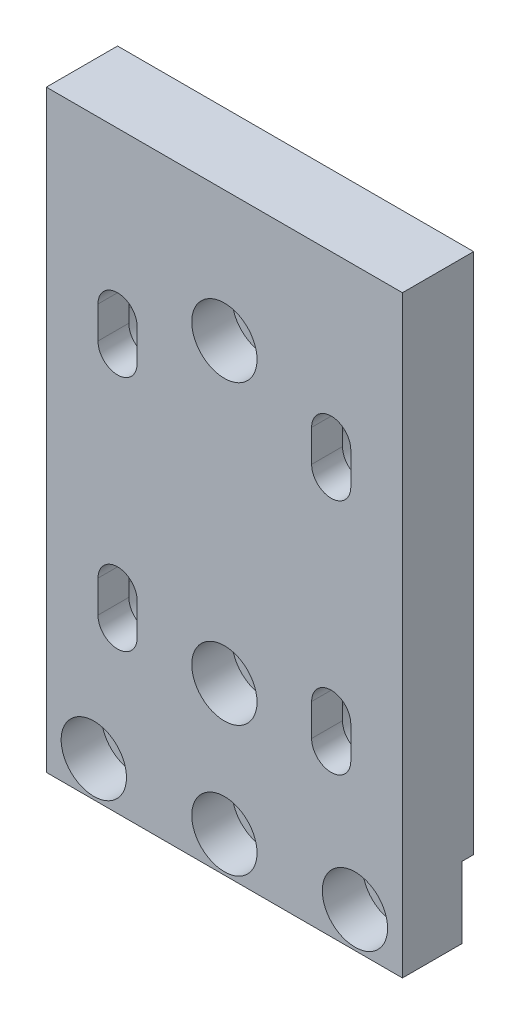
ISO-10303-21;
HEADER;
FILE_DESCRIPTION(('STEP AP214'),'2;1');
FILE_NAME('part.step','',(''),(''),'','','');
FILE_SCHEMA(('AUTOMOTIVE_DESIGN { 1 0 10303 214 1 1 1 1 }'));
ENDSEC;
DATA;
#1=APPLICATION_CONTEXT('core data for automotive mechanical design processes');
#2=APPLICATION_PROTOCOL_DEFINITION('international standard','automotive_design',2000,#1);
#3=PRODUCT_CONTEXT('',#1,'mechanical');
#4=PRODUCT('Part','Part','',(#3));
#5=PRODUCT_RELATED_PRODUCT_CATEGORY('part','',(#4));
#6=PRODUCT_DEFINITION_FORMATION('','',#4);
#7=PRODUCT_DEFINITION_CONTEXT('part definition',#1,'design');
#8=PRODUCT_DEFINITION('design','',#6,#7);
#9=PRODUCT_DEFINITION_SHAPE('','',#8);
#10=(LENGTH_UNIT() NAMED_UNIT(*) SI_UNIT(.MILLI.,.METRE.));
#11=(NAMED_UNIT(*) PLANE_ANGLE_UNIT() SI_UNIT($,.RADIAN.));
#12=(NAMED_UNIT(*) SI_UNIT($,.STERADIAN.) SOLID_ANGLE_UNIT());
#13=UNCERTAINTY_MEASURE_WITH_UNIT(LENGTH_MEASURE(1.E-05),#10,'distance_accuracy_value','');
#14=(GEOMETRIC_REPRESENTATION_CONTEXT(3) GLOBAL_UNCERTAINTY_ASSIGNED_CONTEXT((#13)) GLOBAL_UNIT_ASSIGNED_CONTEXT((#10,
#11,#12)) REPRESENTATION_CONTEXT('',''));
#15=CARTESIAN_POINT('',(0.,0.,0.));
#16=DIRECTION('',(0.,0.,1.));
#17=DIRECTION('',(1.,0.,0.));
#18=AXIS2_PLACEMENT_3D('',#15,#16,#17);
#19=CARTESIAN_POINT('',(0.,0.,0.));
#20=DIRECTION('',(0.,0.,1.));
#21=DIRECTION('',(1.,0.,0.));
#22=AXIS2_PLACEMENT_3D('',#19,#20,#21);
#23=PLANE('',#22);
#24=CARTESIAN_POINT('',(39.733198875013,15.3,0.));
#25=DIRECTION('',(0.,0.,-1.));
#26=DIRECTION('',(-1.,0.,0.));
#27=AXIS2_PLACEMENT_3D('',#24,#25,#26);
#28=CIRCLE('',#27,5.5);
#29=CARTESIAN_POINT('',(45.233198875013,15.3,0.));
#30=VERTEX_POINT('',#29);
#31=CARTESIAN_POINT('',(34.233198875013,15.3,0.));
#32=VERTEX_POINT('',#31);
#33=EDGE_CURVE('E33',#30,#32,#28,.T.);
#34=ORIENTED_EDGE('',*,*,#33,.F.);
#35=DIRECTION('',(0.,1.,0.));
#36=VECTOR('',#35,1.);
#37=CARTESIAN_POINT('',(45.233198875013,15.3,0.));
#38=LINE('',#37,#36);
#39=CARTESIAN_POINT('',(45.233198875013,20.7,0.));
#40=VERTEX_POINT('',#39);
#41=EDGE_CURVE('E267',#30,#40,#38,.T.);
#42=ORIENTED_EDGE('',*,*,#41,.T.);
#43=CARTESIAN_POINT('',(39.7331988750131,20.7,0.));
#44=DIRECTION('',(0.,0.,-1.));
#45=DIRECTION('',(-1.,0.,0.));
#46=AXIS2_PLACEMENT_3D('',#43,#44,#45);
#47=CIRCLE('',#46,5.5);
#48=CARTESIAN_POINT('',(34.2331988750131,20.7,0.));
#49=VERTEX_POINT('',#48);
#50=EDGE_CURVE('E304',#49,#40,#47,.T.);
#51=ORIENTED_EDGE('',*,*,#50,.F.);
#52=DIRECTION('',(0.,1.,0.));
#53=VECTOR('',#52,1.);
#54=CARTESIAN_POINT('',(34.2331988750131,15.3,0.));
#55=LINE('',#54,#53);
#56=EDGE_CURVE('E285',#32,#49,#55,.T.);
#57=ORIENTED_EDGE('',*,*,#56,.F.);
#58=EDGE_LOOP('',(#34,#42,#51,#57));
#59=FACE_BOUND('',#58,.T.);
#60=DIRECTION('',(0.,1.,0.));
#61=VECTOR('',#60,1.);
#62=CARTESIAN_POINT('',(45.233198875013,55.3,0.));
#63=LINE('',#62,#61);
#64=CARTESIAN_POINT('',(45.233198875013,55.3,0.));
#65=VERTEX_POINT('',#64);
#66=CARTESIAN_POINT('',(45.233198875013,60.7,0.));
#67=VERTEX_POINT('',#66);
#68=EDGE_CURVE('E333',#65,#67,#63,.T.);
#69=ORIENTED_EDGE('',*,*,#68,.T.);
#70=CARTESIAN_POINT('',(39.7331988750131,60.7,0.));
#71=DIRECTION('',(0.,0.,-1.));
#72=DIRECTION('',(-1.,0.,0.));
#73=AXIS2_PLACEMENT_3D('',#70,#71,#72);
#74=CIRCLE('',#73,5.5);
#75=CARTESIAN_POINT('',(34.2331988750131,60.7,0.));
#76=VERTEX_POINT('',#75);
#77=EDGE_CURVE('E366',#76,#67,#74,.T.);
#78=ORIENTED_EDGE('',*,*,#77,.F.);
#79=DIRECTION('',(0.,1.,0.));
#80=VECTOR('',#79,1.);
#81=CARTESIAN_POINT('',(34.2331988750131,55.3,0.));
#82=LINE('',#81,#80);
#83=CARTESIAN_POINT('',(34.233198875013,55.3,0.));
#84=VERTEX_POINT('',#83);
#85=EDGE_CURVE('E316',#84,#76,#82,.T.);
#86=ORIENTED_EDGE('',*,*,#85,.F.);
#87=CARTESIAN_POINT('',(39.733198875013,55.3,0.));
#88=DIRECTION('',(0.,0.,-1.));
#89=DIRECTION('',(-1.,0.,0.));
#90=AXIS2_PLACEMENT_3D('',#87,#88,#89);
#91=CIRCLE('',#90,5.5);
#92=EDGE_CURVE('E345',#65,#84,#91,.T.);
#93=ORIENTED_EDGE('',*,*,#92,.F.);
#94=EDGE_LOOP('',(#69,#78,#86,#93));
#95=FACE_BOUND('',#94,.T.);
#96=CARTESIAN_POINT('',(75.733198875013,60.7,0.));
#97=DIRECTION('',(0.,0.,-1.));
#98=DIRECTION('',(-1.,0.,0.));
#99=AXIS2_PLACEMENT_3D('',#96,#97,#98);
#100=CIRCLE('',#99,5.5);
#101=CARTESIAN_POINT('',(70.233198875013,60.7,0.));
#102=VERTEX_POINT('',#101);
#103=CARTESIAN_POINT('',(81.233198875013,60.7,0.));
#104=VERTEX_POINT('',#103);
#105=EDGE_CURVE('E492',#102,#104,#100,.T.);
#106=ORIENTED_EDGE('',*,*,#105,.F.);
#107=DIRECTION('',(0.,1.,0.));
#108=VECTOR('',#107,1.);
#109=CARTESIAN_POINT('',(70.233198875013,55.3,0.));
#110=LINE('',#109,#108);
#111=CARTESIAN_POINT('',(70.233198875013,55.3,0.));
#112=VERTEX_POINT('',#111);
#113=EDGE_CURVE('E444',#112,#102,#110,.T.);
#114=ORIENTED_EDGE('',*,*,#113,.F.);
#115=CARTESIAN_POINT('',(75.733198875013,55.3,0.));
#116=DIRECTION('',(0.,0.,-1.));
#117=DIRECTION('',(-1.,0.,0.));
#118=AXIS2_PLACEMENT_3D('',#115,#116,#117);
#119=CIRCLE('',#118,5.5);
#120=CARTESIAN_POINT('',(81.233198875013,55.3,0.));
#121=VERTEX_POINT('',#120);
#122=EDGE_CURVE('E472',#121,#112,#119,.T.);
#123=ORIENTED_EDGE('',*,*,#122,.F.);
#124=DIRECTION('',(0.,1.,0.));
#125=VECTOR('',#124,1.);
#126=CARTESIAN_POINT('',(81.233198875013,55.3,0.));
#127=LINE('',#126,#125);
#128=EDGE_CURVE('E461',#121,#104,#127,.T.);
#129=ORIENTED_EDGE('',*,*,#128,.T.);
#130=EDGE_LOOP('',(#106,#114,#123,#129));
#131=FACE_BOUND('',#130,.T.);
#132=CARTESIAN_POINT('',(57.733198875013,16.,0.));
#133=DIRECTION('',(0.,0.,1.));
#134=DIRECTION('',(1.,0.,0.));
#135=AXIS2_PLACEMENT_3D('',#132,#133,#134);
#136=CIRCLE('',#135,3.3);
#137=CARTESIAN_POINT('',(61.033198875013,16.,0.));
#138=VERTEX_POINT('',#137);
#139=EDGE_CURVE('E544',#138,#138,#136,.T.);
#140=ORIENTED_EDGE('',*,*,#139,.T.);
#141=EDGE_LOOP('',(#140));
#142=FACE_BOUND('',#141,.T.);
#143=CARTESIAN_POINT('',(57.733198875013,66.,0.));
#144=DIRECTION('',(0.,0.,1.));
#145=DIRECTION('',(1.,0.,0.));
#146=AXIS2_PLACEMENT_3D('',#143,#144,#145);
#147=CIRCLE('',#146,3.3);
#148=CARTESIAN_POINT('',(61.033198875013,66.,0.));
#149=VERTEX_POINT('',#148);
#150=EDGE_CURVE('E556',#149,#149,#147,.T.);
#151=ORIENTED_EDGE('',*,*,#150,.T.);
#152=EDGE_LOOP('',(#151));
#153=FACE_BOUND('',#152,.T.);
#154=DIRECTION('',(0.,1.,0.));
#155=VECTOR('',#154,1.);
#156=CARTESIAN_POINT('',(87.733198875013,-12.,0.));
#157=LINE('',#156,#155);
#158=CARTESIAN_POINT('',(87.733198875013,0.,0.));
#159=VERTEX_POINT('',#158);
#160=CARTESIAN_POINT('',(87.733198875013,88.,0.));
#161=VERTEX_POINT('',#160);
#162=EDGE_CURVE('E574',#159,#161,#157,.T.);
#163=ORIENTED_EDGE('',*,*,#162,.F.);
#164=DIRECTION('',(1.,0.,0.));
#165=VECTOR('',#164,1.);
#166=CARTESIAN_POINT('',(27.733198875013,0.,0.));
#167=LINE('',#166,#165);
#168=CARTESIAN_POINT('',(27.733198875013,0.,0.));
#169=VERTEX_POINT('',#168);
#170=EDGE_CURVE('E567',#169,#159,#167,.T.);
#171=ORIENTED_EDGE('',*,*,#170,.F.);
#172=DIRECTION('',(0.,-1.,0.));
#173=VECTOR('',#172,1.);
#174=CARTESIAN_POINT('',(27.733198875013,-12.,0.));
#175=LINE('',#174,#173);
#176=CARTESIAN_POINT('',(27.733198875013,88.,0.));
#177=VERTEX_POINT('',#176);
#178=EDGE_CURVE('E582',#177,#169,#175,.T.);
#179=ORIENTED_EDGE('',*,*,#178,.F.);
#180=DIRECTION('',(-1.,0.,0.));
#181=VECTOR('',#180,1.);
#182=CARTESIAN_POINT('',(87.733198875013,88.,0.));
#183=LINE('',#182,#181);
#184=EDGE_CURVE('E590',#161,#177,#183,.T.);
#185=ORIENTED_EDGE('',*,*,#184,.F.);
#186=EDGE_LOOP('',(#163,#171,#179,#185));
#187=FACE_BOUND('',#186,.T.);
#188=DIRECTION('',(0.,1.,0.));
#189=VECTOR('',#188,1.);
#190=CARTESIAN_POINT('',(81.233198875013,15.3,0.));
#191=LINE('',#190,#189);
#192=CARTESIAN_POINT('',(81.233198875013,15.3,0.));
#193=VERTEX_POINT('',#192);
#194=CARTESIAN_POINT('',(81.233198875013,20.7,0.));
#195=VERTEX_POINT('',#194);
#196=EDGE_CURVE('E397',#193,#195,#191,.T.);
#197=ORIENTED_EDGE('',*,*,#196,.T.);
#198=CARTESIAN_POINT('',(75.733198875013,20.7,0.));
#199=DIRECTION('',(0.,0.,-1.));
#200=DIRECTION('',(-1.,0.,0.));
#201=AXIS2_PLACEMENT_3D('',#198,#199,#200);
#202=CIRCLE('',#201,5.5);
#203=CARTESIAN_POINT('',(70.233198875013,20.7,0.));
#204=VERTEX_POINT('',#203);
#205=EDGE_CURVE('E430',#204,#195,#202,.T.);
#206=ORIENTED_EDGE('',*,*,#205,.F.);
#207=DIRECTION('',(0.,1.,0.));
#208=VECTOR('',#207,1.);
#209=CARTESIAN_POINT('',(70.233198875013,15.3,0.));
#210=LINE('',#209,#208);
#211=CARTESIAN_POINT('',(70.233198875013,15.3,0.));
#212=VERTEX_POINT('',#211);
#213=EDGE_CURVE('E380',#212,#204,#210,.T.);
#214=ORIENTED_EDGE('',*,*,#213,.F.);
#215=CARTESIAN_POINT('',(75.733198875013,15.3,0.));
#216=DIRECTION('',(0.,0.,-1.));
#217=DIRECTION('',(-1.,0.,0.));
#218=AXIS2_PLACEMENT_3D('',#215,#216,#217);
#219=CIRCLE('',#218,5.5);
#220=EDGE_CURVE('E409',#193,#212,#219,.T.);
#221=ORIENTED_EDGE('',*,*,#220,.F.);
#222=EDGE_LOOP('',(#197,#206,#214,#221));
#223=FACE_BOUND('',#222,.T.);
#224=ADVANCED_FACE('F16',(#59,#95,#131,#142,#153,#187,#223),#23,.F.);
#225=CARTESIAN_POINT('',(87.733198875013,-12.,12.));
#226=DIRECTION('',(-1.,0.,0.));
#227=DIRECTION('',(0.,0.,1.));
#228=AXIS2_PLACEMENT_3D('',#225,#226,#227);
#229=PLANE('',#228);
#230=DIRECTION('',(0.,0.,-1.));
#231=VECTOR('',#230,1.);
#232=CARTESIAN_POINT('',(87.733198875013,-12.,12.));
#233=LINE('',#232,#231);
#234=CARTESIAN_POINT('',(87.733198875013,-12.,12.));
#235=VERTEX_POINT('',#234);
#236=CARTESIAN_POINT('',(87.733198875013,-12.,2.));
#237=VERTEX_POINT('',#236);
#238=EDGE_CURVE('E588',#235,#237,#233,.T.);
#239=ORIENTED_EDGE('',*,*,#238,.T.);
#240=DIRECTION('',(0.,-1.,0.));
#241=VECTOR('',#240,1.);
#242=CARTESIAN_POINT('',(87.733198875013,-12.,2.));
#243=LINE('',#242,#241);
#244=CARTESIAN_POINT('',(87.733198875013,0.,2.));
#245=VERTEX_POINT('',#244);
#246=EDGE_CURVE('E564',#245,#237,#243,.T.);
#247=ORIENTED_EDGE('',*,*,#246,.F.);
#248=DIRECTION('',(0.,0.,1.));
#249=VECTOR('',#248,1.);
#250=CARTESIAN_POINT('',(87.733198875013,0.,0.));
#251=LINE('',#250,#249);
#252=EDGE_CURVE('E559',#159,#245,#251,.T.);
#253=ORIENTED_EDGE('',*,*,#252,.F.);
#254=ORIENTED_EDGE('',*,*,#162,.T.);
#255=DIRECTION('',(0.,0.,-1.));
#256=VECTOR('',#255,1.);
#257=CARTESIAN_POINT('',(87.733198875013,88.,12.));
#258=LINE('',#257,#256);
#259=CARTESIAN_POINT('',(87.733198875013,88.,12.));
#260=VERTEX_POINT('',#259);
#261=EDGE_CURVE('E11',#260,#161,#258,.T.);
#262=ORIENTED_EDGE('',*,*,#261,.F.);
#263=DIRECTION('',(0.,1.,0.));
#264=VECTOR('',#263,1.);
#265=CARTESIAN_POINT('',(87.733198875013,-12.,12.));
#266=LINE('',#265,#264);
#267=EDGE_CURVE('E578',#235,#260,#266,.T.);
#268=ORIENTED_EDGE('',*,*,#267,.F.);
#269=EDGE_LOOP('',(#239,#247,#253,#254,#262,#268));
#270=FACE_BOUND('',#269,.T.);
#271=ADVANCED_FACE('F18',(#270),#229,.F.);
#272=CARTESIAN_POINT('',(87.733198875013,88.,12.));
#273=DIRECTION('',(0.,-1.,0.));
#274=DIRECTION('',(1.,0.,0.));
#275=AXIS2_PLACEMENT_3D('',#272,#273,#274);
#276=PLANE('',#275);
#277=ORIENTED_EDGE('',*,*,#184,.T.);
#278=DIRECTION('',(0.,0.,-1.));
#279=VECTOR('',#278,1.);
#280=CARTESIAN_POINT('',(27.733198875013,88.,12.));
#281=LINE('',#280,#279);
#282=CARTESIAN_POINT('',(27.733198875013,88.,12.));
#283=VERTEX_POINT('',#282);
#284=EDGE_CURVE('E25',#283,#177,#281,.T.);
#285=ORIENTED_EDGE('',*,*,#284,.F.);
#286=DIRECTION('',(-1.,0.,0.));
#287=VECTOR('',#286,1.);
#288=CARTESIAN_POINT('',(87.733198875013,88.,12.));
#289=LINE('',#288,#287);
#290=EDGE_CURVE('E581',#260,#283,#289,.T.);
#291=ORIENTED_EDGE('',*,*,#290,.F.);
#292=ORIENTED_EDGE('',*,*,#261,.T.);
#293=EDGE_LOOP('',(#277,#285,#291,#292));
#294=FACE_BOUND('',#293,.T.);
#295=ADVANCED_FACE('F632',(#294),#276,.F.);
#296=CARTESIAN_POINT('',(27.733198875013,-12.,12.));
#297=DIRECTION('',(1.,0.,0.));
#298=DIRECTION('',(0.,0.,-1.));
#299=AXIS2_PLACEMENT_3D('',#296,#297,#298);
#300=PLANE('',#299);
#301=DIRECTION('',(0.,0.,1.));
#302=VECTOR('',#301,1.);
#303=CARTESIAN_POINT('',(27.733198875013,0.,0.));
#304=LINE('',#303,#302);
#305=CARTESIAN_POINT('',(27.733198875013,0.,2.));
#306=VERTEX_POINT('',#305);
#307=EDGE_CURVE('E560',#169,#306,#304,.T.);
#308=ORIENTED_EDGE('',*,*,#307,.T.);
#309=DIRECTION('',(0.,-1.,0.));
#310=VECTOR('',#309,1.);
#311=CARTESIAN_POINT('',(27.733198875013,-12.,2.));
#312=LINE('',#311,#310);
#313=CARTESIAN_POINT('',(27.733198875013,-12.,2.));
#314=VERTEX_POINT('',#313);
#315=EDGE_CURVE('E563',#306,#314,#312,.T.);
#316=ORIENTED_EDGE('',*,*,#315,.T.);
#317=DIRECTION('',(0.,0.,-1.));
#318=VECTOR('',#317,1.);
#319=CARTESIAN_POINT('',(27.733198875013,-12.,12.));
#320=LINE('',#319,#318);
#321=CARTESIAN_POINT('',(27.733198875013,-12.,12.));
#322=VERTEX_POINT('',#321);
#323=EDGE_CURVE('E596',#322,#314,#320,.T.);
#324=ORIENTED_EDGE('',*,*,#323,.F.);
#325=DIRECTION('',(0.,-1.,0.));
#326=VECTOR('',#325,1.);
#327=CARTESIAN_POINT('',(27.733198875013,-12.,12.));
#328=LINE('',#327,#326);
#329=EDGE_CURVE('E584',#283,#322,#328,.T.);
#330=ORIENTED_EDGE('',*,*,#329,.F.);
#331=ORIENTED_EDGE('',*,*,#284,.T.);
#332=ORIENTED_EDGE('',*,*,#178,.T.);
#333=EDGE_LOOP('',(#308,#316,#324,#330,#331,#332));
#334=FACE_BOUND('',#333,.T.);
#335=ADVANCED_FACE('F641',(#334),#300,.F.);
#336=CARTESIAN_POINT('',(87.733198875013,-12.,12.));
#337=DIRECTION('',(0.,1.,0.));
#338=DIRECTION('',(-1.,0.,0.));
#339=AXIS2_PLACEMENT_3D('',#336,#337,#338);
#340=PLANE('',#339);
#341=ORIENTED_EDGE('',*,*,#323,.T.);
#342=DIRECTION('',(1.,0.,0.));
#343=VECTOR('',#342,1.);
#344=CARTESIAN_POINT('',(27.733198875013,-12.,2.));
#345=LINE('',#344,#343);
#346=EDGE_CURVE('E571',#314,#237,#345,.T.);
#347=ORIENTED_EDGE('',*,*,#346,.T.);
#348=ORIENTED_EDGE('',*,*,#238,.F.);
#349=DIRECTION('',(1.,0.,0.));
#350=VECTOR('',#349,1.);
#351=CARTESIAN_POINT('',(87.733198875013,-12.,12.));
#352=LINE('',#351,#350);
#353=EDGE_CURVE('E586',#322,#235,#352,.T.);
#354=ORIENTED_EDGE('',*,*,#353,.F.);
#355=EDGE_LOOP('',(#341,#347,#348,#354));
#356=FACE_BOUND('',#355,.T.);
#357=ADVANCED_FACE('F638',(#356),#340,.F.);
#358=CARTESIAN_POINT('',(0.,0.,12.));
#359=DIRECTION('',(0.,0.,1.));
#360=DIRECTION('',(1.,0.,0.));
#361=AXIS2_PLACEMENT_3D('',#358,#359,#360);
#362=PLANE('',#361);
#363=CARTESIAN_POINT('',(39.7331988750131,20.7,12.));
#364=DIRECTION('',(0.,0.,-1.));
#365=DIRECTION('',(-1.,0.,0.));
#366=AXIS2_PLACEMENT_3D('',#363,#364,#365);
#367=CIRCLE('',#366,3.3);
#368=CARTESIAN_POINT('',(36.433198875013,20.7,12.));
#369=VERTEX_POINT('',#368);
#370=CARTESIAN_POINT('',(43.033198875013,20.7,12.));
#371=VERTEX_POINT('',#370);
#372=EDGE_CURVE('E41',#369,#371,#367,.T.);
#373=ORIENTED_EDGE('',*,*,#372,.T.);
#374=DIRECTION('',(0.,1.,0.));
#375=VECTOR('',#374,1.);
#376=CARTESIAN_POINT('',(43.033198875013,15.3,12.));
#377=LINE('',#376,#375);
#378=CARTESIAN_POINT('',(43.033198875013,15.3,12.));
#379=VERTEX_POINT('',#378);
#380=EDGE_CURVE('E1213',#379,#371,#377,.T.);
#381=ORIENTED_EDGE('',*,*,#380,.F.);
#382=CARTESIAN_POINT('',(39.733198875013,15.3,12.));
#383=DIRECTION('',(0.,0.,-1.));
#384=DIRECTION('',(-1.,0.,0.));
#385=AXIS2_PLACEMENT_3D('',#382,#383,#384);
#386=CIRCLE('',#385,3.3);
#387=CARTESIAN_POINT('',(36.433198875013,15.3,12.));
#388=VERTEX_POINT('',#387);
#389=EDGE_CURVE('E294',#379,#388,#386,.T.);
#390=ORIENTED_EDGE('',*,*,#389,.T.);
#391=DIRECTION('',(0.,1.,0.));
#392=VECTOR('',#391,1.);
#393=CARTESIAN_POINT('',(36.433198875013,15.3,12.));
#394=LINE('',#393,#392);
#395=EDGE_CURVE('E1208',#388,#369,#394,.T.);
#396=ORIENTED_EDGE('',*,*,#395,.T.);
#397=EDGE_LOOP('',(#373,#381,#390,#396));
#398=FACE_BOUND('',#397,.T.);
#399=DIRECTION('',(0.,1.,0.));
#400=VECTOR('',#399,1.);
#401=CARTESIAN_POINT('',(43.033198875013,55.3,12.));
#402=LINE('',#401,#400);
#403=CARTESIAN_POINT('',(43.033198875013,55.3,12.));
#404=VERTEX_POINT('',#403);
#405=CARTESIAN_POINT('',(43.033198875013,60.7,12.));
#406=VERTEX_POINT('',#405);
#407=EDGE_CURVE('E325',#404,#406,#402,.T.);
#408=ORIENTED_EDGE('',*,*,#407,.F.);
#409=CARTESIAN_POINT('',(39.733198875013,55.3,12.));
#410=DIRECTION('',(0.,0.,-1.));
#411=DIRECTION('',(-1.,0.,0.));
#412=AXIS2_PLACEMENT_3D('',#409,#410,#411);
#413=CIRCLE('',#412,3.3);
#414=CARTESIAN_POINT('',(36.433198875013,55.3,12.));
#415=VERTEX_POINT('',#414);
#416=EDGE_CURVE('E354',#404,#415,#413,.T.);
#417=ORIENTED_EDGE('',*,*,#416,.T.);
#418=DIRECTION('',(0.,1.,0.));
#419=VECTOR('',#418,1.);
#420=CARTESIAN_POINT('',(36.433198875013,55.3,12.));
#421=LINE('',#420,#419);
#422=CARTESIAN_POINT('',(36.433198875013,60.7,12.));
#423=VERTEX_POINT('',#422);
#424=EDGE_CURVE('E322',#415,#423,#421,.T.);
#425=ORIENTED_EDGE('',*,*,#424,.T.);
#426=CARTESIAN_POINT('',(39.7331988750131,60.7,12.));
#427=DIRECTION('',(0.,0.,-1.));
#428=DIRECTION('',(-1.,0.,0.));
#429=AXIS2_PLACEMENT_3D('',#426,#427,#428);
#430=CIRCLE('',#429,3.3);
#431=EDGE_CURVE('E374',#423,#406,#430,.T.);
#432=ORIENTED_EDGE('',*,*,#431,.T.);
#433=EDGE_LOOP('',(#408,#417,#425,#432));
#434=FACE_BOUND('',#433,.T.);
#435=CARTESIAN_POINT('',(75.733198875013,20.7,12.));
#436=DIRECTION('',(0.,0.,-1.));
#437=DIRECTION('',(-1.,0.,0.));
#438=AXIS2_PLACEMENT_3D('',#435,#436,#437);
#439=CIRCLE('',#438,3.3);
#440=CARTESIAN_POINT('',(72.433198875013,20.7,12.));
#441=VERTEX_POINT('',#440);
#442=CARTESIAN_POINT('',(79.033198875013,20.7,12.));
#443=VERTEX_POINT('',#442);
#444=EDGE_CURVE('E438',#441,#443,#439,.T.);
#445=ORIENTED_EDGE('',*,*,#444,.T.);
#446=DIRECTION('',(0.,1.,0.));
#447=VECTOR('',#446,1.);
#448=CARTESIAN_POINT('',(79.033198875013,15.3,12.));
#449=LINE('',#448,#447);
#450=CARTESIAN_POINT('',(79.033198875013,15.3,12.));
#451=VERTEX_POINT('',#450);
#452=EDGE_CURVE('E389',#451,#443,#449,.T.);
#453=ORIENTED_EDGE('',*,*,#452,.F.);
#454=CARTESIAN_POINT('',(75.733198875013,15.3,12.));
#455=DIRECTION('',(0.,0.,-1.));
#456=DIRECTION('',(-1.,0.,0.));
#457=AXIS2_PLACEMENT_3D('',#454,#455,#456);
#458=CIRCLE('',#457,3.3);
#459=CARTESIAN_POINT('',(72.433198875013,15.3,12.));
#460=VERTEX_POINT('',#459);
#461=EDGE_CURVE('E417',#451,#460,#458,.T.);
#462=ORIENTED_EDGE('',*,*,#461,.T.);
#463=DIRECTION('',(0.,1.,0.));
#464=VECTOR('',#463,1.);
#465=CARTESIAN_POINT('',(72.433198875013,15.3,12.));
#466=LINE('',#465,#464);
#467=EDGE_CURVE('E386',#460,#441,#466,.T.);
#468=ORIENTED_EDGE('',*,*,#467,.T.);
#469=EDGE_LOOP('',(#445,#453,#462,#468));
#470=FACE_BOUND('',#469,.T.);
#471=DIRECTION('',(0.,1.,0.));
#472=VECTOR('',#471,1.);
#473=CARTESIAN_POINT('',(72.433198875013,55.3,12.));
#474=LINE('',#473,#472);
#475=CARTESIAN_POINT('',(72.433198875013,55.3,12.));
#476=VERTEX_POINT('',#475);
#477=CARTESIAN_POINT('',(72.433198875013,60.7,12.));
#478=VERTEX_POINT('',#477);
#479=EDGE_CURVE('E450',#476,#478,#474,.T.);
#480=ORIENTED_EDGE('',*,*,#479,.T.);
#481=CARTESIAN_POINT('',(75.733198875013,60.7,12.));
#482=DIRECTION('',(0.,0.,-1.));
#483=DIRECTION('',(-1.,0.,0.));
#484=AXIS2_PLACEMENT_3D('',#481,#482,#483);
#485=CIRCLE('',#484,3.3);
#486=CARTESIAN_POINT('',(79.033198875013,60.7,12.));
#487=VERTEX_POINT('',#486);
#488=EDGE_CURVE('E500',#478,#487,#485,.T.);
#489=ORIENTED_EDGE('',*,*,#488,.T.);
#490=DIRECTION('',(0.,1.,0.));
#491=VECTOR('',#490,1.);
#492=CARTESIAN_POINT('',(79.033198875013,55.3,12.));
#493=LINE('',#492,#491);
#494=CARTESIAN_POINT('',(79.033198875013,55.3,12.));
#495=VERTEX_POINT('',#494);
#496=EDGE_CURVE('E453',#495,#487,#493,.T.);
#497=ORIENTED_EDGE('',*,*,#496,.F.);
#498=CARTESIAN_POINT('',(75.733198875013,55.3,12.));
#499=DIRECTION('',(0.,0.,-1.));
#500=DIRECTION('',(-1.,0.,0.));
#501=AXIS2_PLACEMENT_3D('',#498,#499,#500);
#502=CIRCLE('',#501,3.3);
#503=EDGE_CURVE('E480',#495,#476,#502,.T.);
#504=ORIENTED_EDGE('',*,*,#503,.T.);
#505=EDGE_LOOP('',(#480,#489,#497,#504));
#506=FACE_BOUND('',#505,.T.);
#507=CARTESIAN_POINT('',(79.733198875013,-6.,12.));
#508=DIRECTION('',(0.,0.,1.));
#509=DIRECTION('',(1.,0.,0.));
#510=AXIS2_PLACEMENT_3D('',#507,#508,#509);
#511=CIRCLE('',#510,5.5);
#512=CARTESIAN_POINT('',(85.233198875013,-6.,12.));
#513=VERTEX_POINT('',#512);
#514=EDGE_CURVE('E506',#513,#513,#511,.T.);
#515=ORIENTED_EDGE('',*,*,#514,.F.);
#516=EDGE_LOOP('',(#515));
#517=FACE_BOUND('',#516,.T.);
#518=CARTESIAN_POINT('',(57.733198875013,-6.,12.));
#519=DIRECTION('',(0.,0.,1.));
#520=DIRECTION('',(1.,0.,0.));
#521=AXIS2_PLACEMENT_3D('',#518,#519,#520);
#522=CIRCLE('',#521,5.5);
#523=CARTESIAN_POINT('',(63.233198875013,-6.,12.));
#524=VERTEX_POINT('',#523);
#525=EDGE_CURVE('E515',#524,#524,#522,.T.);
#526=ORIENTED_EDGE('',*,*,#525,.F.);
#527=EDGE_LOOP('',(#526));
#528=FACE_BOUND('',#527,.T.);
#529=CARTESIAN_POINT('',(35.733198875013,-6.,12.));
#530=DIRECTION('',(0.,0.,1.));
#531=DIRECTION('',(1.,0.,0.));
#532=AXIS2_PLACEMENT_3D('',#529,#530,#531);
#533=CIRCLE('',#532,5.5);
#534=CARTESIAN_POINT('',(41.233198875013,-6.,12.));
#535=VERTEX_POINT('',#534);
#536=EDGE_CURVE('E525',#535,#535,#533,.T.);
#537=ORIENTED_EDGE('',*,*,#536,.F.);
#538=EDGE_LOOP('',(#537));
#539=FACE_BOUND('',#538,.T.);
#540=CARTESIAN_POINT('',(57.733198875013,16.,12.));
#541=DIRECTION('',(0.,0.,1.));
#542=DIRECTION('',(1.,0.,0.));
#543=AXIS2_PLACEMENT_3D('',#540,#541,#542);
#544=CIRCLE('',#543,5.5);
#545=CARTESIAN_POINT('',(63.233198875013,16.,12.));
#546=VERTEX_POINT('',#545);
#547=EDGE_CURVE('E535',#546,#546,#544,.T.);
#548=ORIENTED_EDGE('',*,*,#547,.F.);
#549=EDGE_LOOP('',(#548));
#550=FACE_BOUND('',#549,.T.);
#551=CARTESIAN_POINT('',(57.733198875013,66.,12.));
#552=DIRECTION('',(0.,0.,1.));
#553=DIRECTION('',(1.,0.,0.));
#554=AXIS2_PLACEMENT_3D('',#551,#552,#553);
#555=CIRCLE('',#554,5.5);
#556=CARTESIAN_POINT('',(63.233198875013,66.,12.));
#557=VERTEX_POINT('',#556);
#558=EDGE_CURVE('E547',#557,#557,#555,.T.);
#559=ORIENTED_EDGE('',*,*,#558,.F.);
#560=EDGE_LOOP('',(#559));
#561=FACE_BOUND('',#560,.T.);
#562=ORIENTED_EDGE('',*,*,#267,.T.);
#563=ORIENTED_EDGE('',*,*,#290,.T.);
#564=ORIENTED_EDGE('',*,*,#329,.T.);
#565=ORIENTED_EDGE('',*,*,#353,.T.);
#566=EDGE_LOOP('',(#562,#563,#564,#565));
#567=FACE_BOUND('',#566,.T.);
#568=ADVANCED_FACE('F636',(#398,#434,#470,#506,#517,#528,#539,#550,#561,#567),#362,.T.);
#569=CARTESIAN_POINT('',(27.733198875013,-12.,2.));
#570=DIRECTION('',(0.,0.,1.));
#571=DIRECTION('',(1.,0.,0.));
#572=AXIS2_PLACEMENT_3D('',#569,#570,#571);
#573=PLANE('',#572);
#574=CARTESIAN_POINT('',(79.733198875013,-6.,2.));
#575=DIRECTION('',(0.,0.,1.));
#576=DIRECTION('',(1.,0.,0.));
#577=AXIS2_PLACEMENT_3D('',#574,#575,#576);
#578=CIRCLE('',#577,3.3);
#579=CARTESIAN_POINT('',(83.033198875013,-6.,2.));
#580=VERTEX_POINT('',#579);
#581=EDGE_CURVE('E20',#580,#580,#578,.T.);
#582=ORIENTED_EDGE('',*,*,#581,.T.);
#583=EDGE_LOOP('',(#582));
#584=FACE_BOUND('',#583,.T.);
#585=CARTESIAN_POINT('',(57.733198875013,-6.,2.));
#586=DIRECTION('',(0.,0.,1.));
#587=DIRECTION('',(1.,0.,0.));
#588=AXIS2_PLACEMENT_3D('',#585,#586,#587);
#589=CIRCLE('',#588,3.3);
#590=CARTESIAN_POINT('',(61.033198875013,-6.,2.));
#591=VERTEX_POINT('',#590);
#592=EDGE_CURVE('E524',#591,#591,#589,.T.);
#593=ORIENTED_EDGE('',*,*,#592,.T.);
#594=EDGE_LOOP('',(#593));
#595=FACE_BOUND('',#594,.T.);
#596=CARTESIAN_POINT('',(35.733198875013,-6.,2.));
#597=DIRECTION('',(0.,0.,1.));
#598=DIRECTION('',(1.,0.,0.));
#599=AXIS2_PLACEMENT_3D('',#596,#597,#598);
#600=CIRCLE('',#599,3.3);
#601=CARTESIAN_POINT('',(39.033198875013,-6.,2.));
#602=VERTEX_POINT('',#601);
#603=EDGE_CURVE('E534',#602,#602,#600,.T.);
#604=ORIENTED_EDGE('',*,*,#603,.T.);
#605=EDGE_LOOP('',(#604));
#606=FACE_BOUND('',#605,.T.);
#607=ORIENTED_EDGE('',*,*,#246,.T.);
#608=ORIENTED_EDGE('',*,*,#346,.F.);
#609=ORIENTED_EDGE('',*,*,#315,.F.);
#610=DIRECTION('',(1.,0.,0.));
#611=VECTOR('',#610,1.);
#612=CARTESIAN_POINT('',(27.733198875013,0.,2.));
#613=LINE('',#612,#611);
#614=EDGE_CURVE('E575',#306,#245,#613,.T.);
#615=ORIENTED_EDGE('',*,*,#614,.T.);
#616=EDGE_LOOP('',(#607,#608,#609,#615));
#617=FACE_BOUND('',#616,.T.);
#618=ADVANCED_FACE('F605',(#584,#595,#606,#617),#573,.F.);
#619=CARTESIAN_POINT('',(27.733198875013,0.,0.));
#620=DIRECTION('',(0.,1.,0.));
#621=DIRECTION('',(0.,0.,1.));
#622=AXIS2_PLACEMENT_3D('',#619,#620,#621);
#623=PLANE('',#622);
#624=ORIENTED_EDGE('',*,*,#252,.T.);
#625=ORIENTED_EDGE('',*,*,#614,.F.);
#626=ORIENTED_EDGE('',*,*,#307,.F.);
#627=ORIENTED_EDGE('',*,*,#170,.T.);
#628=EDGE_LOOP('',(#624,#625,#626,#627));
#629=FACE_BOUND('',#628,.T.);
#630=ADVANCED_FACE('F662',(#629),#623,.F.);
#631=CARTESIAN_POINT('',(57.733198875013,66.,12.));
#632=DIRECTION('',(0.,0.,1.));
#633=DIRECTION('',(1.,0.,0.));
#634=AXIS2_PLACEMENT_3D('',#631,#632,#633);
#635=CYLINDRICAL_SURFACE('',#634,3.3);
#636=ORIENTED_EDGE('',*,*,#150,.F.);
#637=EDGE_LOOP('',(#636));
#638=FACE_BOUND('',#637,.T.);
#639=CARTESIAN_POINT('',(57.733198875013,66.,5.2));
#640=DIRECTION('',(0.,0.,1.));
#641=DIRECTION('',(1.,0.,0.));
#642=AXIS2_PLACEMENT_3D('',#639,#640,#641);
#643=CIRCLE('',#642,3.3);
#644=CARTESIAN_POINT('',(61.033198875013,66.,5.2));
#645=VERTEX_POINT('',#644);
#646=EDGE_CURVE('E553',#645,#645,#643,.T.);
#647=ORIENTED_EDGE('',*,*,#646,.T.);
#648=EDGE_LOOP('',(#647));
#649=FACE_BOUND('',#648,.T.);
#650=ADVANCED_FACE('F710',(#638,#649),#635,.F.);
#651=CARTESIAN_POINT('',(61.033198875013,66.,5.2));
#652=DIRECTION('',(0.,0.,-1.));
#653=DIRECTION('',(-1.,0.,0.));
#654=AXIS2_PLACEMENT_3D('',#651,#652,#653);
#655=PLANE('',#654);
#656=ORIENTED_EDGE('',*,*,#646,.F.);
#657=EDGE_LOOP('',(#656));
#658=FACE_BOUND('',#657,.T.);
#659=CARTESIAN_POINT('',(57.733198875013,66.,5.2));
#660=DIRECTION('',(0.,0.,1.));
#661=DIRECTION('',(1.,0.,0.));
#662=AXIS2_PLACEMENT_3D('',#659,#660,#661);
#663=CIRCLE('',#662,5.5);
#664=CARTESIAN_POINT('',(63.233198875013,66.,5.2));
#665=VERTEX_POINT('',#664);
#666=EDGE_CURVE('E550',#665,#665,#663,.T.);
#667=ORIENTED_EDGE('',*,*,#666,.T.);
#668=EDGE_LOOP('',(#667));
#669=FACE_BOUND('',#668,.T.);
#670=ADVANCED_FACE('F699',(#658,#669),#655,.F.);
#671=CARTESIAN_POINT('',(57.733198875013,66.,12.));
#672=DIRECTION('',(0.,0.,1.));
#673=DIRECTION('',(1.,0.,0.));
#674=AXIS2_PLACEMENT_3D('',#671,#672,#673);
#675=CYLINDRICAL_SURFACE('',#674,5.5);
#676=ORIENTED_EDGE('',*,*,#666,.F.);
#677=EDGE_LOOP('',(#676));
#678=FACE_BOUND('',#677,.T.);
#679=ORIENTED_EDGE('',*,*,#558,.T.);
#680=EDGE_LOOP('',(#679));
#681=FACE_BOUND('',#680,.T.);
#682=ADVANCED_FACE('F696',(#678,#681),#675,.F.);
#683=CARTESIAN_POINT('',(57.733198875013,16.,12.));
#684=DIRECTION('',(0.,0.,1.));
#685=DIRECTION('',(1.,0.,0.));
#686=AXIS2_PLACEMENT_3D('',#683,#684,#685);
#687=CYLINDRICAL_SURFACE('',#686,3.3);
#688=ORIENTED_EDGE('',*,*,#139,.F.);
#689=EDGE_LOOP('',(#688));
#690=FACE_BOUND('',#689,.T.);
#691=CARTESIAN_POINT('',(57.733198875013,16.,5.2));
#692=DIRECTION('',(0.,0.,1.));
#693=DIRECTION('',(1.,0.,0.));
#694=AXIS2_PLACEMENT_3D('',#691,#692,#693);
#695=CIRCLE('',#694,3.3);
#696=CARTESIAN_POINT('',(61.033198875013,16.,5.2));
#697=VERTEX_POINT('',#696);
#698=EDGE_CURVE('E541',#697,#697,#695,.T.);
#699=ORIENTED_EDGE('',*,*,#698,.T.);
#700=EDGE_LOOP('',(#699));
#701=FACE_BOUND('',#700,.T.);
#702=ADVANCED_FACE('F698',(#690,#701),#687,.F.);
#703=CARTESIAN_POINT('',(61.033198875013,16.,5.2));
#704=DIRECTION('',(0.,0.,-1.));
#705=DIRECTION('',(-1.,0.,0.));
#706=AXIS2_PLACEMENT_3D('',#703,#704,#705);
#707=PLANE('',#706);
#708=ORIENTED_EDGE('',*,*,#698,.F.);
#709=EDGE_LOOP('',(#708));
#710=FACE_BOUND('',#709,.T.);
#711=CARTESIAN_POINT('',(57.733198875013,16.,5.2));
#712=DIRECTION('',(0.,0.,1.));
#713=DIRECTION('',(1.,0.,0.));
#714=AXIS2_PLACEMENT_3D('',#711,#712,#713);
#715=CIRCLE('',#714,5.5);
#716=CARTESIAN_POINT('',(63.233198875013,16.,5.2));
#717=VERTEX_POINT('',#716);
#718=EDGE_CURVE('E538',#717,#717,#715,.T.);
#719=ORIENTED_EDGE('',*,*,#718,.T.);
#720=EDGE_LOOP('',(#719));
#721=FACE_BOUND('',#720,.T.);
#722=ADVANCED_FACE('F707',(#710,#721),#707,.F.);
#723=CARTESIAN_POINT('',(57.733198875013,16.,12.));
#724=DIRECTION('',(0.,0.,1.));
#725=DIRECTION('',(1.,0.,0.));
#726=AXIS2_PLACEMENT_3D('',#723,#724,#725);
#727=CYLINDRICAL_SURFACE('',#726,5.5);
#728=ORIENTED_EDGE('',*,*,#718,.F.);
#729=EDGE_LOOP('',(#728));
#730=FACE_BOUND('',#729,.T.);
#731=ORIENTED_EDGE('',*,*,#547,.T.);
#732=EDGE_LOOP('',(#731));
#733=FACE_BOUND('',#732,.T.);
#734=ADVANCED_FACE('F758',(#730,#733),#727,.F.);
#735=CARTESIAN_POINT('',(35.733198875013,-6.,12.));
#736=DIRECTION('',(0.,0.,1.));
#737=DIRECTION('',(1.,0.,0.));
#738=AXIS2_PLACEMENT_3D('',#735,#736,#737);
#739=CYLINDRICAL_SURFACE('',#738,3.3);
#740=CARTESIAN_POINT('',(35.733198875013,-6.,5.2));
#741=DIRECTION('',(0.,0.,1.));
#742=DIRECTION('',(1.,0.,0.));
#743=AXIS2_PLACEMENT_3D('',#740,#741,#742);
#744=CIRCLE('',#743,3.3);
#745=CARTESIAN_POINT('',(39.033198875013,-6.,5.2));
#746=VERTEX_POINT('',#745);
#747=EDGE_CURVE('E531',#746,#746,#744,.T.);
#748=ORIENTED_EDGE('',*,*,#747,.T.);
#749=EDGE_LOOP('',(#748));
#750=FACE_BOUND('',#749,.T.);
#751=ORIENTED_EDGE('',*,*,#603,.F.);
#752=EDGE_LOOP('',(#751));
#753=FACE_BOUND('',#752,.T.);
#754=ADVANCED_FACE('F767',(#750,#753),#739,.F.);
#755=CARTESIAN_POINT('',(39.033198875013,-6.,5.2));
#756=DIRECTION('',(0.,0.,-1.));
#757=DIRECTION('',(-1.,0.,0.));
#758=AXIS2_PLACEMENT_3D('',#755,#756,#757);
#759=PLANE('',#758);
#760=ORIENTED_EDGE('',*,*,#747,.F.);
#761=EDGE_LOOP('',(#760));
#762=FACE_BOUND('',#761,.T.);
#763=CARTESIAN_POINT('',(35.733198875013,-6.,5.2));
#764=DIRECTION('',(0.,0.,1.));
#765=DIRECTION('',(1.,0.,0.));
#766=AXIS2_PLACEMENT_3D('',#763,#764,#765);
#767=CIRCLE('',#766,5.5);
#768=CARTESIAN_POINT('',(41.233198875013,-6.,5.2));
#769=VERTEX_POINT('',#768);
#770=EDGE_CURVE('E528',#769,#769,#767,.T.);
#771=ORIENTED_EDGE('',*,*,#770,.T.);
#772=EDGE_LOOP('',(#771));
#773=FACE_BOUND('',#772,.T.);
#774=ADVANCED_FACE('F623',(#762,#773),#759,.F.);
#775=CARTESIAN_POINT('',(35.733198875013,-6.,12.));
#776=DIRECTION('',(0.,0.,1.));
#777=DIRECTION('',(1.,0.,0.));
#778=AXIS2_PLACEMENT_3D('',#775,#776,#777);
#779=CYLINDRICAL_SURFACE('',#778,5.5);
#780=ORIENTED_EDGE('',*,*,#770,.F.);
#781=EDGE_LOOP('',(#780));
#782=FACE_BOUND('',#781,.T.);
#783=ORIENTED_EDGE('',*,*,#536,.T.);
#784=EDGE_LOOP('',(#783));
#785=FACE_BOUND('',#784,.T.);
#786=ADVANCED_FACE('F611',(#782,#785),#779,.F.);
#787=CARTESIAN_POINT('',(57.733198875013,-6.,12.));
#788=DIRECTION('',(0.,0.,1.));
#789=DIRECTION('',(1.,0.,0.));
#790=AXIS2_PLACEMENT_3D('',#787,#788,#789);
#791=CYLINDRICAL_SURFACE('',#790,3.3);
#792=CARTESIAN_POINT('',(57.733198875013,-6.,5.2));
#793=DIRECTION('',(0.,0.,1.));
#794=DIRECTION('',(1.,0.,0.));
#795=AXIS2_PLACEMENT_3D('',#792,#793,#794);
#796=CIRCLE('',#795,3.3);
#797=CARTESIAN_POINT('',(61.033198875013,-6.,5.2));
#798=VERTEX_POINT('',#797);
#799=EDGE_CURVE('E521',#798,#798,#796,.T.);
#800=ORIENTED_EDGE('',*,*,#799,.T.);
#801=EDGE_LOOP('',(#800));
#802=FACE_BOUND('',#801,.T.);
#803=ORIENTED_EDGE('',*,*,#592,.F.);
#804=EDGE_LOOP('',(#803));
#805=FACE_BOUND('',#804,.T.);
#806=ADVANCED_FACE('F608',(#802,#805),#791,.F.);
#807=CARTESIAN_POINT('',(61.033198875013,-6.,5.2));
#808=DIRECTION('',(0.,0.,-1.));
#809=DIRECTION('',(-1.,0.,0.));
#810=AXIS2_PLACEMENT_3D('',#807,#808,#809);
#811=PLANE('',#810);
#812=ORIENTED_EDGE('',*,*,#799,.F.);
#813=EDGE_LOOP('',(#812));
#814=FACE_BOUND('',#813,.T.);
#815=CARTESIAN_POINT('',(57.733198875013,-6.,5.2));
#816=DIRECTION('',(0.,0.,1.));
#817=DIRECTION('',(1.,0.,0.));
#818=AXIS2_PLACEMENT_3D('',#815,#816,#817);
#819=CIRCLE('',#818,5.5);
#820=CARTESIAN_POINT('',(63.233198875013,-6.,5.2));
#821=VERTEX_POINT('',#820);
#822=EDGE_CURVE('E518',#821,#821,#819,.T.);
#823=ORIENTED_EDGE('',*,*,#822,.T.);
#824=EDGE_LOOP('',(#823));
#825=FACE_BOUND('',#824,.T.);
#826=ADVANCED_FACE('F610',(#814,#825),#811,.F.);
#827=CARTESIAN_POINT('',(57.733198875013,-6.,12.));
#828=DIRECTION('',(0.,0.,1.));
#829=DIRECTION('',(1.,0.,0.));
#830=AXIS2_PLACEMENT_3D('',#827,#828,#829);
#831=CYLINDRICAL_SURFACE('',#830,5.5);
#832=ORIENTED_EDGE('',*,*,#822,.F.);
#833=EDGE_LOOP('',(#832));
#834=FACE_BOUND('',#833,.T.);
#835=ORIENTED_EDGE('',*,*,#525,.T.);
#836=EDGE_LOOP('',(#835));
#837=FACE_BOUND('',#836,.T.);
#838=ADVANCED_FACE('F620',(#834,#837),#831,.F.);
#839=CARTESIAN_POINT('',(79.733198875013,-6.,12.));
#840=DIRECTION('',(0.,0.,1.));
#841=DIRECTION('',(1.,0.,0.));
#842=AXIS2_PLACEMENT_3D('',#839,#840,#841);
#843=CYLINDRICAL_SURFACE('',#842,3.3);
#844=CARTESIAN_POINT('',(79.733198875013,-6.,5.2));
#845=DIRECTION('',(0.,0.,1.));
#846=DIRECTION('',(1.,0.,0.));
#847=AXIS2_PLACEMENT_3D('',#844,#845,#846);
#848=CIRCLE('',#847,3.3);
#849=CARTESIAN_POINT('',(83.033198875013,-6.,5.2));
#850=VERTEX_POINT('',#849);
#851=EDGE_CURVE('E512',#850,#850,#848,.T.);
#852=ORIENTED_EDGE('',*,*,#851,.T.);
#853=EDGE_LOOP('',(#852));
#854=FACE_BOUND('',#853,.T.);
#855=ORIENTED_EDGE('',*,*,#581,.F.);
#856=EDGE_LOOP('',(#855));
#857=FACE_BOUND('',#856,.T.);
#858=ADVANCED_FACE('F811',(#854,#857),#843,.F.);
#859=CARTESIAN_POINT('',(83.033198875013,-6.,5.2));
#860=DIRECTION('',(0.,0.,-1.));
#861=DIRECTION('',(-1.,0.,0.));
#862=AXIS2_PLACEMENT_3D('',#859,#860,#861);
#863=PLANE('',#862);
#864=ORIENTED_EDGE('',*,*,#851,.F.);
#865=EDGE_LOOP('',(#864));
#866=FACE_BOUND('',#865,.T.);
#867=CARTESIAN_POINT('',(79.733198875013,-6.,5.2));
#868=DIRECTION('',(0.,0.,1.));
#869=DIRECTION('',(1.,0.,0.));
#870=AXIS2_PLACEMENT_3D('',#867,#868,#869);
#871=CIRCLE('',#870,5.5);
#872=CARTESIAN_POINT('',(85.233198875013,-6.,5.2));
#873=VERTEX_POINT('',#872);
#874=EDGE_CURVE('E509',#873,#873,#871,.T.);
#875=ORIENTED_EDGE('',*,*,#874,.T.);
#876=EDGE_LOOP('',(#875));
#877=FACE_BOUND('',#876,.T.);
#878=ADVANCED_FACE('F821',(#866,#877),#863,.F.);
#879=CARTESIAN_POINT('',(79.733198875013,-6.,12.));
#880=DIRECTION('',(0.,0.,1.));
#881=DIRECTION('',(1.,0.,0.));
#882=AXIS2_PLACEMENT_3D('',#879,#880,#881);
#883=CYLINDRICAL_SURFACE('',#882,5.5);
#884=ORIENTED_EDGE('',*,*,#874,.F.);
#885=EDGE_LOOP('',(#884));
#886=FACE_BOUND('',#885,.T.);
#887=ORIENTED_EDGE('',*,*,#514,.T.);
#888=EDGE_LOOP('',(#887));
#889=FACE_BOUND('',#888,.T.);
#890=ADVANCED_FACE('F831',(#886,#889),#883,.F.);
#891=CARTESIAN_POINT('',(75.733198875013,60.7,0.));
#892=DIRECTION('',(0.,0.,-1.));
#893=DIRECTION('',(-1.,0.,0.));
#894=AXIS2_PLACEMENT_3D('',#891,#892,#893);
#895=CYLINDRICAL_SURFACE('',#894,3.3);
#896=CARTESIAN_POINT('',(75.733198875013,60.7,6.8));
#897=DIRECTION('',(0.,0.,-1.));
#898=DIRECTION('',(-1.,0.,0.));
#899=AXIS2_PLACEMENT_3D('',#896,#897,#898);
#900=CIRCLE('',#899,3.3);
#901=CARTESIAN_POINT('',(72.433198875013,60.7,6.8));
#902=VERTEX_POINT('',#901);
#903=CARTESIAN_POINT('',(79.033198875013,60.7,6.8));
#904=VERTEX_POINT('',#903);
#905=EDGE_CURVE('E497',#902,#904,#900,.T.);
#906=ORIENTED_EDGE('',*,*,#905,.T.);
#907=DIRECTION('',(0.,0.,1.));
#908=VECTOR('',#907,1.);
#909=CARTESIAN_POINT('',(79.033198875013,60.7,12.));
#910=LINE('',#909,#908);
#911=EDGE_CURVE('E490',#904,#487,#910,.T.);
#912=ORIENTED_EDGE('',*,*,#911,.T.);
#913=ORIENTED_EDGE('',*,*,#488,.F.);
#914=DIRECTION('',(0.,0.,-1.));
#915=VECTOR('',#914,1.);
#916=CARTESIAN_POINT('',(72.433198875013,60.7,0.));
#917=LINE('',#916,#915);
#918=EDGE_CURVE('E486',#902,#478,#917,.F.);
#919=ORIENTED_EDGE('',*,*,#918,.F.);
#920=EDGE_LOOP('',(#906,#912,#913,#919));
#921=FACE_BOUND('',#920,.T.);
#922=ADVANCED_FACE('F841',(#921),#895,.F.);
#923=CARTESIAN_POINT('',(79.033198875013,60.7,6.8));
#924=DIRECTION('',(0.,0.,1.));
#925=DIRECTION('',(1.,0.,0.));
#926=AXIS2_PLACEMENT_3D('',#923,#924,#925);
#927=PLANE('',#926);
#928=ORIENTED_EDGE('',*,*,#905,.F.);
#929=DIRECTION('',(0.,1.,0.));
#930=VECTOR('',#929,1.);
#931=CARTESIAN_POINT('',(72.433198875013,55.3,6.8));
#932=LINE('',#931,#930);
#933=CARTESIAN_POINT('',(72.433198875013,55.3,6.8));
#934=VERTEX_POINT('',#933);
#935=EDGE_CURVE('E448',#934,#902,#932,.T.);
#936=ORIENTED_EDGE('',*,*,#935,.F.);
#937=CARTESIAN_POINT('',(75.733198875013,55.3,6.8));
#938=DIRECTION('',(0.,0.,-1.));
#939=DIRECTION('',(-1.,0.,0.));
#940=AXIS2_PLACEMENT_3D('',#937,#938,#939);
#941=CIRCLE('',#940,3.3);
#942=CARTESIAN_POINT('',(79.033198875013,55.3,6.8));
#943=VERTEX_POINT('',#942);
#944=EDGE_CURVE('E477',#943,#934,#941,.T.);
#945=ORIENTED_EDGE('',*,*,#944,.F.);
#946=DIRECTION('',(0.,1.,0.));
#947=VECTOR('',#946,1.);
#948=CARTESIAN_POINT('',(79.033198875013,55.3,6.8));
#949=LINE('',#948,#947);
#950=EDGE_CURVE('E456',#943,#904,#949,.T.);
#951=ORIENTED_EDGE('',*,*,#950,.T.);
#952=EDGE_LOOP('',(#928,#936,#945,#951));
#953=FACE_BOUND('',#952,.T.);
#954=CARTESIAN_POINT('',(75.733198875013,60.7,6.8));
#955=DIRECTION('',(0.,0.,-1.));
#956=DIRECTION('',(-1.,0.,0.));
#957=AXIS2_PLACEMENT_3D('',#954,#955,#956);
#958=CIRCLE('',#957,5.5);
#959=CARTESIAN_POINT('',(70.233198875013,60.7,6.8));
#960=VERTEX_POINT('',#959);
#961=CARTESIAN_POINT('',(81.233198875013,60.7,6.8));
#962=VERTEX_POINT('',#961);
#963=EDGE_CURVE('E494',#960,#962,#958,.T.);
#964=ORIENTED_EDGE('',*,*,#963,.T.);
#965=DIRECTION('',(0.,1.,0.));
#966=VECTOR('',#965,1.);
#967=CARTESIAN_POINT('',(81.233198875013,55.3,6.8));
#968=LINE('',#967,#966);
#969=CARTESIAN_POINT('',(81.233198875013,55.3,6.8));
#970=VERTEX_POINT('',#969);
#971=EDGE_CURVE('E458',#970,#962,#968,.T.);
#972=ORIENTED_EDGE('',*,*,#971,.F.);
#973=CARTESIAN_POINT('',(75.733198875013,55.3,6.8));
#974=DIRECTION('',(0.,0.,-1.));
#975=DIRECTION('',(-1.,0.,0.));
#976=AXIS2_PLACEMENT_3D('',#973,#974,#975);
#977=CIRCLE('',#976,5.5);
#978=CARTESIAN_POINT('',(70.233198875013,55.3,6.8));
#979=VERTEX_POINT('',#978);
#980=EDGE_CURVE('E474',#970,#979,#977,.T.);
#981=ORIENTED_EDGE('',*,*,#980,.T.);
#982=DIRECTION('',(0.,1.,0.));
#983=VECTOR('',#982,1.);
#984=CARTESIAN_POINT('',(70.233198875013,55.3,6.8));
#985=LINE('',#984,#983);
#986=EDGE_CURVE('E446',#979,#960,#985,.T.);
#987=ORIENTED_EDGE('',*,*,#986,.T.);
#988=EDGE_LOOP('',(#964,#972,#981,#987));
#989=FACE_BOUND('',#988,.T.);
#990=ADVANCED_FACE('F851',(#953,#989),#927,.F.);
#991=CARTESIAN_POINT('',(75.733198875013,60.7,0.));
#992=DIRECTION('',(0.,0.,-1.));
#993=DIRECTION('',(-1.,0.,0.));
#994=AXIS2_PLACEMENT_3D('',#991,#992,#993);
#995=CYLINDRICAL_SURFACE('',#994,5.5);
#996=ORIENTED_EDGE('',*,*,#105,.T.);
#997=DIRECTION('',(0.,0.,1.));
#998=VECTOR('',#997,1.);
#999=CARTESIAN_POINT('',(81.233198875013,60.7,6.8));
#1000=LINE('',#999,#998);
#1001=EDGE_CURVE('E488',#104,#962,#1000,.T.);
#1002=ORIENTED_EDGE('',*,*,#1001,.T.);
#1003=ORIENTED_EDGE('',*,*,#963,.F.);
#1004=DIRECTION('',(0.,0.,-1.));
#1005=VECTOR('',#1004,1.);
#1006=CARTESIAN_POINT('',(70.233198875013,60.7,0.));
#1007=LINE('',#1006,#1005);
#1008=EDGE_CURVE('E503',#102,#960,#1007,.F.);
#1009=ORIENTED_EDGE('',*,*,#1008,.F.);
#1010=EDGE_LOOP('',(#996,#1002,#1003,#1009));
#1011=FACE_BOUND('',#1010,.T.);
#1012=ADVANCED_FACE('F861',(#1011),#995,.F.);
#1013=CARTESIAN_POINT('',(75.733198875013,55.3,0.));
#1014=DIRECTION('',(0.,0.,-1.));
#1015=DIRECTION('',(-1.,0.,0.));
#1016=AXIS2_PLACEMENT_3D('',#1013,#1014,#1015);
#1017=CYLINDRICAL_SURFACE('',#1016,3.3);
#1018=ORIENTED_EDGE('',*,*,#503,.F.);
#1019=DIRECTION('',(0.,0.,1.));
#1020=VECTOR('',#1019,1.);
#1021=CARTESIAN_POINT('',(79.033198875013,55.3,12.));
#1022=LINE('',#1021,#1020);
#1023=EDGE_CURVE('E470',#943,#495,#1022,.T.);
#1024=ORIENTED_EDGE('',*,*,#1023,.F.);
#1025=ORIENTED_EDGE('',*,*,#944,.T.);
#1026=DIRECTION('',(0.,0.,-1.));
#1027=VECTOR('',#1026,1.);
#1028=CARTESIAN_POINT('',(72.433198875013,55.3,0.));
#1029=LINE('',#1028,#1027);
#1030=EDGE_CURVE('E464',#476,#934,#1029,.T.);
#1031=ORIENTED_EDGE('',*,*,#1030,.F.);
#1032=EDGE_LOOP('',(#1018,#1024,#1025,#1031));
#1033=FACE_BOUND('',#1032,.T.);
#1034=ADVANCED_FACE('F871',(#1033),#1017,.F.);
#1035=CARTESIAN_POINT('',(75.733198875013,55.3,0.));
#1036=DIRECTION('',(0.,0.,-1.));
#1037=DIRECTION('',(-1.,0.,0.));
#1038=AXIS2_PLACEMENT_3D('',#1035,#1036,#1037);
#1039=CYLINDRICAL_SURFACE('',#1038,5.5);
#1040=ORIENTED_EDGE('',*,*,#980,.F.);
#1041=DIRECTION('',(0.,0.,1.));
#1042=VECTOR('',#1041,1.);
#1043=CARTESIAN_POINT('',(81.233198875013,55.3,6.8));
#1044=LINE('',#1043,#1042);
#1045=EDGE_CURVE('E467',#121,#970,#1044,.T.);
#1046=ORIENTED_EDGE('',*,*,#1045,.F.);
#1047=ORIENTED_EDGE('',*,*,#122,.T.);
#1048=DIRECTION('',(0.,0.,-1.));
#1049=VECTOR('',#1048,1.);
#1050=CARTESIAN_POINT('',(70.233198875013,55.3,0.));
#1051=LINE('',#1050,#1049);
#1052=EDGE_CURVE('E483',#979,#112,#1051,.T.);
#1053=ORIENTED_EDGE('',*,*,#1052,.F.);
#1054=EDGE_LOOP('',(#1040,#1046,#1047,#1053));
#1055=FACE_BOUND('',#1054,.T.);
#1056=ADVANCED_FACE('F881',(#1055),#1039,.F.);
#1057=CARTESIAN_POINT('',(81.233198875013,55.3,6.8));
#1058=DIRECTION('',(-1.,0.,0.));
#1059=DIRECTION('',(0.,0.,1.));
#1060=AXIS2_PLACEMENT_3D('',#1057,#1058,#1059);
#1061=PLANE('',#1060);
#1062=ORIENTED_EDGE('',*,*,#1001,.F.);
#1063=ORIENTED_EDGE('',*,*,#128,.F.);
#1064=ORIENTED_EDGE('',*,*,#1045,.T.);
#1065=ORIENTED_EDGE('',*,*,#971,.T.);
#1066=EDGE_LOOP('',(#1062,#1063,#1064,#1065));
#1067=FACE_BOUND('',#1066,.T.);
#1068=ADVANCED_FACE('F891',(#1067),#1061,.T.);
#1069=CARTESIAN_POINT('',(79.033198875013,55.3,12.));
#1070=DIRECTION('',(-1.,0.,0.));
#1071=DIRECTION('',(0.,0.,1.));
#1072=AXIS2_PLACEMENT_3D('',#1069,#1070,#1071);
#1073=PLANE('',#1072);
#1074=ORIENTED_EDGE('',*,*,#911,.F.);
#1075=ORIENTED_EDGE('',*,*,#950,.F.);
#1076=ORIENTED_EDGE('',*,*,#1023,.T.);
#1077=ORIENTED_EDGE('',*,*,#496,.T.);
#1078=EDGE_LOOP('',(#1074,#1075,#1076,#1077));
#1079=FACE_BOUND('',#1078,.T.);
#1080=ADVANCED_FACE('F901',(#1079),#1073,.T.);
#1081=CARTESIAN_POINT('',(72.433198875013,55.3,0.));
#1082=DIRECTION('',(-1.,0.,0.));
#1083=DIRECTION('',(0.,0.,1.));
#1084=AXIS2_PLACEMENT_3D('',#1081,#1082,#1083);
#1085=PLANE('',#1084);
#1086=ORIENTED_EDGE('',*,*,#918,.T.);
#1087=ORIENTED_EDGE('',*,*,#479,.F.);
#1088=ORIENTED_EDGE('',*,*,#1030,.T.);
#1089=ORIENTED_EDGE('',*,*,#935,.T.);
#1090=EDGE_LOOP('',(#1086,#1087,#1088,#1089));
#1091=FACE_BOUND('',#1090,.T.);
#1092=ADVANCED_FACE('F911',(#1091),#1085,.F.);
#1093=CARTESIAN_POINT('',(70.233198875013,55.3,0.));
#1094=DIRECTION('',(-1.,0.,0.));
#1095=DIRECTION('',(0.,0.,1.));
#1096=AXIS2_PLACEMENT_3D('',#1093,#1094,#1095);
#1097=PLANE('',#1096);
#1098=ORIENTED_EDGE('',*,*,#1008,.T.);
#1099=ORIENTED_EDGE('',*,*,#986,.F.);
#1100=ORIENTED_EDGE('',*,*,#1052,.T.);
#1101=ORIENTED_EDGE('',*,*,#113,.T.);
#1102=EDGE_LOOP('',(#1098,#1099,#1100,#1101));
#1103=FACE_BOUND('',#1102,.T.);
#1104=ADVANCED_FACE('F921',(#1103),#1097,.F.);
#1105=CARTESIAN_POINT('',(75.733198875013,20.7,0.));
#1106=DIRECTION('',(0.,0.,-1.));
#1107=DIRECTION('',(-1.,0.,0.));
#1108=AXIS2_PLACEMENT_3D('',#1105,#1106,#1107);
#1109=CYLINDRICAL_SURFACE('',#1108,3.3);
#1110=CARTESIAN_POINT('',(75.733198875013,20.7,6.8));
#1111=DIRECTION('',(0.,0.,-1.));
#1112=DIRECTION('',(-1.,0.,0.));
#1113=AXIS2_PLACEMENT_3D('',#1110,#1111,#1112);
#1114=CIRCLE('',#1113,3.3);
#1115=CARTESIAN_POINT('',(72.433198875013,20.7,6.8));
#1116=VERTEX_POINT('',#1115);
#1117=CARTESIAN_POINT('',(79.033198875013,20.7,6.8));
#1118=VERTEX_POINT('',#1117);
#1119=EDGE_CURVE('E435',#1116,#1118,#1114,.T.);
#1120=ORIENTED_EDGE('',*,*,#1119,.T.);
#1121=DIRECTION('',(0.,0.,1.));
#1122=VECTOR('',#1121,1.);
#1123=CARTESIAN_POINT('',(79.033198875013,20.7,12.));
#1124=LINE('',#1123,#1122);
#1125=EDGE_CURVE('E428',#1118,#443,#1124,.T.);
#1126=ORIENTED_EDGE('',*,*,#1125,.T.);
#1127=ORIENTED_EDGE('',*,*,#444,.F.);
#1128=DIRECTION('',(0.,0.,-1.));
#1129=VECTOR('',#1128,1.);
#1130=CARTESIAN_POINT('',(72.433198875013,20.7,0.));
#1131=LINE('',#1130,#1129);
#1132=EDGE_CURVE('E423',#1116,#441,#1131,.F.);
#1133=ORIENTED_EDGE('',*,*,#1132,.F.);
#1134=EDGE_LOOP('',(#1120,#1126,#1127,#1133));
#1135=FACE_BOUND('',#1134,.T.);
#1136=ADVANCED_FACE('F931',(#1135),#1109,.F.);
#1137=CARTESIAN_POINT('',(79.033198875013,20.7,6.8));
#1138=DIRECTION('',(0.,0.,1.));
#1139=DIRECTION('',(1.,0.,0.));
#1140=AXIS2_PLACEMENT_3D('',#1137,#1138,#1139);
#1141=PLANE('',#1140);
#1142=ORIENTED_EDGE('',*,*,#1119,.F.);
#1143=DIRECTION('',(0.,1.,0.));
#1144=VECTOR('',#1143,1.);
#1145=CARTESIAN_POINT('',(72.433198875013,15.3,6.8));
#1146=LINE('',#1145,#1144);
#1147=CARTESIAN_POINT('',(72.433198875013,15.3,6.8));
#1148=VERTEX_POINT('',#1147);
#1149=EDGE_CURVE('E384',#1148,#1116,#1146,.T.);
#1150=ORIENTED_EDGE('',*,*,#1149,.F.);
#1151=CARTESIAN_POINT('',(75.733198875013,15.3,6.8));
#1152=DIRECTION('',(0.,0.,-1.));
#1153=DIRECTION('',(-1.,0.,0.));
#1154=AXIS2_PLACEMENT_3D('',#1151,#1152,#1153);
#1155=CIRCLE('',#1154,3.3);
#1156=CARTESIAN_POINT('',(79.033198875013,15.3,6.8));
#1157=VERTEX_POINT('',#1156);
#1158=EDGE_CURVE('E414',#1157,#1148,#1155,.T.);
#1159=ORIENTED_EDGE('',*,*,#1158,.F.);
#1160=DIRECTION('',(0.,1.,0.));
#1161=VECTOR('',#1160,1.);
#1162=CARTESIAN_POINT('',(79.033198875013,15.3,6.8));
#1163=LINE('',#1162,#1161);
#1164=EDGE_CURVE('E392',#1157,#1118,#1163,.T.);
#1165=ORIENTED_EDGE('',*,*,#1164,.T.);
#1166=EDGE_LOOP('',(#1142,#1150,#1159,#1165));
#1167=FACE_BOUND('',#1166,.T.);
#1168=CARTESIAN_POINT('',(75.733198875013,20.7,6.8));
#1169=DIRECTION('',(0.,0.,-1.));
#1170=DIRECTION('',(-1.,0.,0.));
#1171=AXIS2_PLACEMENT_3D('',#1168,#1169,#1170);
#1172=CIRCLE('',#1171,5.5);
#1173=CARTESIAN_POINT('',(70.233198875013,20.7,6.8));
#1174=VERTEX_POINT('',#1173);
#1175=CARTESIAN_POINT('',(81.233198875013,20.7,6.8));
#1176=VERTEX_POINT('',#1175);
#1177=EDGE_CURVE('E432',#1174,#1176,#1172,.T.);
#1178=ORIENTED_EDGE('',*,*,#1177,.T.);
#1179=DIRECTION('',(0.,1.,0.));
#1180=VECTOR('',#1179,1.);
#1181=CARTESIAN_POINT('',(81.233198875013,15.3,6.8));
#1182=LINE('',#1181,#1180);
#1183=CARTESIAN_POINT('',(81.233198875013,15.3,6.8));
#1184=VERTEX_POINT('',#1183);
#1185=EDGE_CURVE('E394',#1184,#1176,#1182,.T.);
#1186=ORIENTED_EDGE('',*,*,#1185,.F.);
#1187=CARTESIAN_POINT('',(75.733198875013,15.3,6.8));
#1188=DIRECTION('',(0.,0.,-1.));
#1189=DIRECTION('',(-1.,0.,0.));
#1190=AXIS2_PLACEMENT_3D('',#1187,#1188,#1189);
#1191=CIRCLE('',#1190,5.5);
#1192=CARTESIAN_POINT('',(70.233198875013,15.3,6.8));
#1193=VERTEX_POINT('',#1192);
#1194=EDGE_CURVE('E411',#1184,#1193,#1191,.T.);
#1195=ORIENTED_EDGE('',*,*,#1194,.T.);
#1196=DIRECTION('',(0.,1.,0.));
#1197=VECTOR('',#1196,1.);
#1198=CARTESIAN_POINT('',(70.233198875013,15.3,6.8));
#1199=LINE('',#1198,#1197);
#1200=EDGE_CURVE('E382',#1193,#1174,#1199,.T.);
#1201=ORIENTED_EDGE('',*,*,#1200,.T.);
#1202=EDGE_LOOP('',(#1178,#1186,#1195,#1201));
#1203=FACE_BOUND('',#1202,.T.);
#1204=ADVANCED_FACE('F941',(#1167,#1203),#1141,.F.);
#1205=CARTESIAN_POINT('',(75.733198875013,20.7,0.));
#1206=DIRECTION('',(0.,0.,-1.));
#1207=DIRECTION('',(-1.,0.,0.));
#1208=AXIS2_PLACEMENT_3D('',#1205,#1206,#1207);
#1209=CYLINDRICAL_SURFACE('',#1208,5.5);
#1210=ORIENTED_EDGE('',*,*,#205,.T.);
#1211=DIRECTION('',(0.,0.,1.));
#1212=VECTOR('',#1211,1.);
#1213=CARTESIAN_POINT('',(81.233198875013,20.7,6.8));
#1214=LINE('',#1213,#1212);
#1215=EDGE_CURVE('E426',#195,#1176,#1214,.T.);
#1216=ORIENTED_EDGE('',*,*,#1215,.T.);
#1217=ORIENTED_EDGE('',*,*,#1177,.F.);
#1218=DIRECTION('',(0.,0.,-1.));
#1219=VECTOR('',#1218,1.);
#1220=CARTESIAN_POINT('',(70.233198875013,20.7,0.));
#1221=LINE('',#1220,#1219);
#1222=EDGE_CURVE('E441',#204,#1174,#1221,.F.);
#1223=ORIENTED_EDGE('',*,*,#1222,.F.);
#1224=EDGE_LOOP('',(#1210,#1216,#1217,#1223));
#1225=FACE_BOUND('',#1224,.T.);
#1226=ADVANCED_FACE('F951',(#1225),#1209,.F.);
#1227=CARTESIAN_POINT('',(75.733198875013,15.3,0.));
#1228=DIRECTION('',(0.,0.,-1.));
#1229=DIRECTION('',(-1.,0.,0.));
#1230=AXIS2_PLACEMENT_3D('',#1227,#1228,#1229);
#1231=CYLINDRICAL_SURFACE('',#1230,3.3);
#1232=ORIENTED_EDGE('',*,*,#461,.F.);
#1233=DIRECTION('',(0.,0.,1.));
#1234=VECTOR('',#1233,1.);
#1235=CARTESIAN_POINT('',(79.033198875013,15.3,12.));
#1236=LINE('',#1235,#1234);
#1237=EDGE_CURVE('E406',#1157,#451,#1236,.T.);
#1238=ORIENTED_EDGE('',*,*,#1237,.F.);
#1239=ORIENTED_EDGE('',*,*,#1158,.T.);
#1240=DIRECTION('',(0.,0.,-1.));
#1241=VECTOR('',#1240,1.);
#1242=CARTESIAN_POINT('',(72.433198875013,15.3,0.));
#1243=LINE('',#1242,#1241);
#1244=EDGE_CURVE('E400',#460,#1148,#1243,.T.);
#1245=ORIENTED_EDGE('',*,*,#1244,.F.);
#1246=EDGE_LOOP('',(#1232,#1238,#1239,#1245));
#1247=FACE_BOUND('',#1246,.T.);
#1248=ADVANCED_FACE('F961',(#1247),#1231,.F.);
#1249=CARTESIAN_POINT('',(75.733198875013,15.3,0.));
#1250=DIRECTION('',(0.,0.,-1.));
#1251=DIRECTION('',(-1.,0.,0.));
#1252=AXIS2_PLACEMENT_3D('',#1249,#1250,#1251);
#1253=CYLINDRICAL_SURFACE('',#1252,5.5);
#1254=ORIENTED_EDGE('',*,*,#1194,.F.);
#1255=DIRECTION('',(0.,0.,1.));
#1256=VECTOR('',#1255,1.);
#1257=CARTESIAN_POINT('',(81.233198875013,15.3,6.8));
#1258=LINE('',#1257,#1256);
#1259=EDGE_CURVE('E403',#193,#1184,#1258,.T.);
#1260=ORIENTED_EDGE('',*,*,#1259,.F.);
#1261=ORIENTED_EDGE('',*,*,#220,.T.);
#1262=DIRECTION('',(0.,0.,-1.));
#1263=VECTOR('',#1262,1.);
#1264=CARTESIAN_POINT('',(70.233198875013,15.3,0.));
#1265=LINE('',#1264,#1263);
#1266=EDGE_CURVE('E420',#1193,#212,#1265,.T.);
#1267=ORIENTED_EDGE('',*,*,#1266,.F.);
#1268=EDGE_LOOP('',(#1254,#1260,#1261,#1267));
#1269=FACE_BOUND('',#1268,.T.);
#1270=ADVANCED_FACE('F971',(#1269),#1253,.F.);
#1271=CARTESIAN_POINT('',(81.233198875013,15.3,6.8));
#1272=DIRECTION('',(-1.,0.,0.));
#1273=DIRECTION('',(0.,0.,1.));
#1274=AXIS2_PLACEMENT_3D('',#1271,#1272,#1273);
#1275=PLANE('',#1274);
#1276=ORIENTED_EDGE('',*,*,#1215,.F.);
#1277=ORIENTED_EDGE('',*,*,#196,.F.);
#1278=ORIENTED_EDGE('',*,*,#1259,.T.);
#1279=ORIENTED_EDGE('',*,*,#1185,.T.);
#1280=EDGE_LOOP('',(#1276,#1277,#1278,#1279));
#1281=FACE_BOUND('',#1280,.T.);
#1282=ADVANCED_FACE('F981',(#1281),#1275,.T.);
#1283=CARTESIAN_POINT('',(79.033198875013,15.3,12.));
#1284=DIRECTION('',(-1.,0.,0.));
#1285=DIRECTION('',(0.,0.,1.));
#1286=AXIS2_PLACEMENT_3D('',#1283,#1284,#1285);
#1287=PLANE('',#1286);
#1288=ORIENTED_EDGE('',*,*,#1125,.F.);
#1289=ORIENTED_EDGE('',*,*,#1164,.F.);
#1290=ORIENTED_EDGE('',*,*,#1237,.T.);
#1291=ORIENTED_EDGE('',*,*,#452,.T.);
#1292=EDGE_LOOP('',(#1288,#1289,#1290,#1291));
#1293=FACE_BOUND('',#1292,.T.);
#1294=ADVANCED_FACE('F991',(#1293),#1287,.T.);
#1295=CARTESIAN_POINT('',(72.433198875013,15.3,0.));
#1296=DIRECTION('',(-1.,0.,0.));
#1297=DIRECTION('',(0.,0.,1.));
#1298=AXIS2_PLACEMENT_3D('',#1295,#1296,#1297);
#1299=PLANE('',#1298);
#1300=ORIENTED_EDGE('',*,*,#1132,.T.);
#1301=ORIENTED_EDGE('',*,*,#467,.F.);
#1302=ORIENTED_EDGE('',*,*,#1244,.T.);
#1303=ORIENTED_EDGE('',*,*,#1149,.T.);
#1304=EDGE_LOOP('',(#1300,#1301,#1302,#1303));
#1305=FACE_BOUND('',#1304,.T.);
#1306=ADVANCED_FACE('F1001',(#1305),#1299,.F.);
#1307=CARTESIAN_POINT('',(70.233198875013,15.3,0.));
#1308=DIRECTION('',(-1.,0.,0.));
#1309=DIRECTION('',(0.,0.,1.));
#1310=AXIS2_PLACEMENT_3D('',#1307,#1308,#1309);
#1311=PLANE('',#1310);
#1312=ORIENTED_EDGE('',*,*,#1222,.T.);
#1313=ORIENTED_EDGE('',*,*,#1200,.F.);
#1314=ORIENTED_EDGE('',*,*,#1266,.T.);
#1315=ORIENTED_EDGE('',*,*,#213,.T.);
#1316=EDGE_LOOP('',(#1312,#1313,#1314,#1315));
#1317=FACE_BOUND('',#1316,.T.);
#1318=ADVANCED_FACE('F1011',(#1317),#1311,.F.);
#1319=CARTESIAN_POINT('',(39.7331988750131,60.7,0.));
#1320=DIRECTION('',(0.,0.,-1.));
#1321=DIRECTION('',(-1.,0.,0.));
#1322=AXIS2_PLACEMENT_3D('',#1319,#1320,#1321);
#1323=CYLINDRICAL_SURFACE('',#1322,3.3);
#1324=CARTESIAN_POINT('',(39.7331988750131,60.7,6.8));
#1325=DIRECTION('',(0.,0.,-1.));
#1326=DIRECTION('',(-1.,0.,0.));
#1327=AXIS2_PLACEMENT_3D('',#1324,#1325,#1326);
#1328=CIRCLE('',#1327,3.3);
#1329=CARTESIAN_POINT('',(36.433198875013,60.7,6.8));
#1330=VERTEX_POINT('',#1329);
#1331=CARTESIAN_POINT('',(43.033198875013,60.7,6.8));
#1332=VERTEX_POINT('',#1331);
#1333=EDGE_CURVE('E371',#1330,#1332,#1328,.T.);
#1334=ORIENTED_EDGE('',*,*,#1333,.T.);
#1335=DIRECTION('',(0.,0.,1.));
#1336=VECTOR('',#1335,1.);
#1337=CARTESIAN_POINT('',(43.033198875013,60.7,12.));
#1338=LINE('',#1337,#1336);
#1339=EDGE_CURVE('E364',#1332,#406,#1338,.T.);
#1340=ORIENTED_EDGE('',*,*,#1339,.T.);
#1341=ORIENTED_EDGE('',*,*,#431,.F.);
#1342=DIRECTION('',(0.,0.,-1.));
#1343=VECTOR('',#1342,1.);
#1344=CARTESIAN_POINT('',(36.433198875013,60.7,0.));
#1345=LINE('',#1344,#1343);
#1346=EDGE_CURVE('E359',#1330,#423,#1345,.F.);
#1347=ORIENTED_EDGE('',*,*,#1346,.F.);
#1348=EDGE_LOOP('',(#1334,#1340,#1341,#1347));
#1349=FACE_BOUND('',#1348,.T.);
#1350=ADVANCED_FACE('F1021',(#1349),#1323,.F.);
#1351=CARTESIAN_POINT('',(43.033198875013,60.7,6.8));
#1352=DIRECTION('',(0.,0.,1.));
#1353=DIRECTION('',(1.,0.,0.));
#1354=AXIS2_PLACEMENT_3D('',#1351,#1352,#1353);
#1355=PLANE('',#1354);
#1356=ORIENTED_EDGE('',*,*,#1333,.F.);
#1357=DIRECTION('',(0.,1.,0.));
#1358=VECTOR('',#1357,1.);
#1359=CARTESIAN_POINT('',(36.433198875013,55.3,6.8));
#1360=LINE('',#1359,#1358);
#1361=CARTESIAN_POINT('',(36.433198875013,55.3,6.8));
#1362=VERTEX_POINT('',#1361);
#1363=EDGE_CURVE('E320',#1362,#1330,#1360,.T.);
#1364=ORIENTED_EDGE('',*,*,#1363,.F.);
#1365=CARTESIAN_POINT('',(39.733198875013,55.3,6.8));
#1366=DIRECTION('',(0.,0.,-1.));
#1367=DIRECTION('',(-1.,0.,0.));
#1368=AXIS2_PLACEMENT_3D('',#1365,#1366,#1367);
#1369=CIRCLE('',#1368,3.3);
#1370=CARTESIAN_POINT('',(43.033198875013,55.3,6.8));
#1371=VERTEX_POINT('',#1370);
#1372=EDGE_CURVE('E351',#1371,#1362,#1369,.T.);
#1373=ORIENTED_EDGE('',*,*,#1372,.F.);
#1374=DIRECTION('',(0.,1.,0.));
#1375=VECTOR('',#1374,1.);
#1376=CARTESIAN_POINT('',(43.033198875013,55.3,6.8));
#1377=LINE('',#1376,#1375);
#1378=EDGE_CURVE('E328',#1371,#1332,#1377,.T.);
#1379=ORIENTED_EDGE('',*,*,#1378,.T.);
#1380=EDGE_LOOP('',(#1356,#1364,#1373,#1379));
#1381=FACE_BOUND('',#1380,.T.);
#1382=CARTESIAN_POINT('',(39.7331988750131,60.7,6.8));
#1383=DIRECTION('',(0.,0.,-1.));
#1384=DIRECTION('',(-1.,0.,0.));
#1385=AXIS2_PLACEMENT_3D('',#1382,#1383,#1384);
#1386=CIRCLE('',#1385,5.5);
#1387=CARTESIAN_POINT('',(34.2331988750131,60.7,6.8));
#1388=VERTEX_POINT('',#1387);
#1389=CARTESIAN_POINT('',(45.233198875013,60.7,6.8));
#1390=VERTEX_POINT('',#1389);
#1391=EDGE_CURVE('E368',#1388,#1390,#1386,.T.);
#1392=ORIENTED_EDGE('',*,*,#1391,.T.);
#1393=DIRECTION('',(0.,1.,0.));
#1394=VECTOR('',#1393,1.);
#1395=CARTESIAN_POINT('',(45.233198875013,55.3,6.8));
#1396=LINE('',#1395,#1394);
#1397=CARTESIAN_POINT('',(45.233198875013,55.3,6.8));
#1398=VERTEX_POINT('',#1397);
#1399=EDGE_CURVE('E330',#1398,#1390,#1396,.T.);
#1400=ORIENTED_EDGE('',*,*,#1399,.F.);
#1401=CARTESIAN_POINT('',(39.733198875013,55.3,6.8));
#1402=DIRECTION('',(0.,0.,-1.));
#1403=DIRECTION('',(-1.,0.,0.));
#1404=AXIS2_PLACEMENT_3D('',#1401,#1402,#1403);
#1405=CIRCLE('',#1404,5.5);
#1406=CARTESIAN_POINT('',(34.233198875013,55.3,6.8));
#1407=VERTEX_POINT('',#1406);
#1408=EDGE_CURVE('E348',#1398,#1407,#1405,.T.);
#1409=ORIENTED_EDGE('',*,*,#1408,.T.);
#1410=DIRECTION('',(0.,1.,0.));
#1411=VECTOR('',#1410,1.);
#1412=CARTESIAN_POINT('',(34.233198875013,55.3,6.8));
#1413=LINE('',#1412,#1411);
#1414=EDGE_CURVE('E318',#1407,#1388,#1413,.T.);
#1415=ORIENTED_EDGE('',*,*,#1414,.T.);
#1416=EDGE_LOOP('',(#1392,#1400,#1409,#1415));
#1417=FACE_BOUND('',#1416,.T.);
#1418=ADVANCED_FACE('F1031',(#1381,#1417),#1355,.F.);
#1419=CARTESIAN_POINT('',(39.7331988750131,60.7,0.));
#1420=DIRECTION('',(0.,0.,-1.));
#1421=DIRECTION('',(-1.,0.,0.));
#1422=AXIS2_PLACEMENT_3D('',#1419,#1420,#1421);
#1423=CYLINDRICAL_SURFACE('',#1422,5.5);
#1424=ORIENTED_EDGE('',*,*,#77,.T.);
#1425=DIRECTION('',(0.,0.,1.));
#1426=VECTOR('',#1425,1.);
#1427=CARTESIAN_POINT('',(45.233198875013,60.7,6.8));
#1428=LINE('',#1427,#1426);
#1429=EDGE_CURVE('E362',#67,#1390,#1428,.T.);
#1430=ORIENTED_EDGE('',*,*,#1429,.T.);
#1431=ORIENTED_EDGE('',*,*,#1391,.F.);
#1432=DIRECTION('',(0.,0.,-1.));
#1433=VECTOR('',#1432,1.);
#1434=CARTESIAN_POINT('',(34.2331988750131,60.7,0.));
#1435=LINE('',#1434,#1433);
#1436=EDGE_CURVE('E377',#76,#1388,#1435,.F.);
#1437=ORIENTED_EDGE('',*,*,#1436,.F.);
#1438=EDGE_LOOP('',(#1424,#1430,#1431,#1437));
#1439=FACE_BOUND('',#1438,.T.);
#1440=ADVANCED_FACE('F1041',(#1439),#1423,.F.);
#1441=CARTESIAN_POINT('',(39.733198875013,55.3,0.));
#1442=DIRECTION('',(0.,0.,-1.));
#1443=DIRECTION('',(-1.,0.,0.));
#1444=AXIS2_PLACEMENT_3D('',#1441,#1442,#1443);
#1445=CYLINDRICAL_SURFACE('',#1444,3.3);
#1446=ORIENTED_EDGE('',*,*,#416,.F.);
#1447=DIRECTION('',(0.,0.,1.));
#1448=VECTOR('',#1447,1.);
#1449=CARTESIAN_POINT('',(43.033198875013,55.3,12.));
#1450=LINE('',#1449,#1448);
#1451=EDGE_CURVE('E342',#1371,#404,#1450,.T.);
#1452=ORIENTED_EDGE('',*,*,#1451,.F.);
#1453=ORIENTED_EDGE('',*,*,#1372,.T.);
#1454=DIRECTION('',(0.,0.,-1.));
#1455=VECTOR('',#1454,1.);
#1456=CARTESIAN_POINT('',(36.433198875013,55.3,0.));
#1457=LINE('',#1456,#1455);
#1458=EDGE_CURVE('E336',#415,#1362,#1457,.T.);
#1459=ORIENTED_EDGE('',*,*,#1458,.F.);
#1460=EDGE_LOOP('',(#1446,#1452,#1453,#1459));
#1461=FACE_BOUND('',#1460,.T.);
#1462=ADVANCED_FACE('F1051',(#1461),#1445,.F.);
#1463=CARTESIAN_POINT('',(39.733198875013,55.3,0.));
#1464=DIRECTION('',(0.,0.,-1.));
#1465=DIRECTION('',(-1.,0.,0.));
#1466=AXIS2_PLACEMENT_3D('',#1463,#1464,#1465);
#1467=CYLINDRICAL_SURFACE('',#1466,5.5);
#1468=ORIENTED_EDGE('',*,*,#1408,.F.);
#1469=DIRECTION('',(0.,0.,1.));
#1470=VECTOR('',#1469,1.);
#1471=CARTESIAN_POINT('',(45.233198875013,55.3,6.8));
#1472=LINE('',#1471,#1470);
#1473=EDGE_CURVE('E339',#65,#1398,#1472,.T.);
#1474=ORIENTED_EDGE('',*,*,#1473,.F.);
#1475=ORIENTED_EDGE('',*,*,#92,.T.);
#1476=DIRECTION('',(0.,0.,-1.));
#1477=VECTOR('',#1476,1.);
#1478=CARTESIAN_POINT('',(34.233198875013,55.3,0.));
#1479=LINE('',#1478,#1477);
#1480=EDGE_CURVE('E357',#1407,#84,#1479,.T.);
#1481=ORIENTED_EDGE('',*,*,#1480,.F.);
#1482=EDGE_LOOP('',(#1468,#1474,#1475,#1481));
#1483=FACE_BOUND('',#1482,.T.);
#1484=ADVANCED_FACE('F1061',(#1483),#1467,.F.);
#1485=CARTESIAN_POINT('',(45.233198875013,55.3,6.8));
#1486=DIRECTION('',(-1.,0.,0.));
#1487=DIRECTION('',(0.,-1.,0.));
#1488=AXIS2_PLACEMENT_3D('',#1485,#1486,#1487);
#1489=PLANE('',#1488);
#1490=ORIENTED_EDGE('',*,*,#1429,.F.);
#1491=ORIENTED_EDGE('',*,*,#68,.F.);
#1492=ORIENTED_EDGE('',*,*,#1473,.T.);
#1493=ORIENTED_EDGE('',*,*,#1399,.T.);
#1494=EDGE_LOOP('',(#1490,#1491,#1492,#1493));
#1495=FACE_BOUND('',#1494,.T.);
#1496=ADVANCED_FACE('F1071',(#1495),#1489,.T.);
#1497=CARTESIAN_POINT('',(43.033198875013,55.3,12.));
#1498=DIRECTION('',(-1.,0.,0.));
#1499=DIRECTION('',(0.,-1.,0.));
#1500=AXIS2_PLACEMENT_3D('',#1497,#1498,#1499);
#1501=PLANE('',#1500);
#1502=ORIENTED_EDGE('',*,*,#1339,.F.);
#1503=ORIENTED_EDGE('',*,*,#1378,.F.);
#1504=ORIENTED_EDGE('',*,*,#1451,.T.);
#1505=ORIENTED_EDGE('',*,*,#407,.T.);
#1506=EDGE_LOOP('',(#1502,#1503,#1504,#1505));
#1507=FACE_BOUND('',#1506,.T.);
#1508=ADVANCED_FACE('F1081',(#1507),#1501,.T.);
#1509=CARTESIAN_POINT('',(36.433198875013,55.3,0.));
#1510=DIRECTION('',(-1.,0.,0.));
#1511=DIRECTION('',(0.,-1.,0.));
#1512=AXIS2_PLACEMENT_3D('',#1509,#1510,#1511);
#1513=PLANE('',#1512);
#1514=ORIENTED_EDGE('',*,*,#1346,.T.);
#1515=ORIENTED_EDGE('',*,*,#424,.F.);
#1516=ORIENTED_EDGE('',*,*,#1458,.T.);
#1517=ORIENTED_EDGE('',*,*,#1363,.T.);
#1518=EDGE_LOOP('',(#1514,#1515,#1516,#1517));
#1519=FACE_BOUND('',#1518,.T.);
#1520=ADVANCED_FACE('F1091',(#1519),#1513,.F.);
#1521=CARTESIAN_POINT('',(34.233198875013,55.3,0.));
#1522=DIRECTION('',(-1.,0.,0.));
#1523=DIRECTION('',(0.,-1.,0.));
#1524=AXIS2_PLACEMENT_3D('',#1521,#1522,#1523);
#1525=PLANE('',#1524);
#1526=ORIENTED_EDGE('',*,*,#1436,.T.);
#1527=ORIENTED_EDGE('',*,*,#1414,.F.);
#1528=ORIENTED_EDGE('',*,*,#1480,.T.);
#1529=ORIENTED_EDGE('',*,*,#85,.T.);
#1530=EDGE_LOOP('',(#1526,#1527,#1528,#1529));
#1531=FACE_BOUND('',#1530,.T.);
#1532=ADVANCED_FACE('F1101',(#1531),#1525,.F.);
#1533=CARTESIAN_POINT('',(39.7331988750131,20.7,0.));
#1534=DIRECTION('',(0.,0.,-1.));
#1535=DIRECTION('',(-1.,0.,0.));
#1536=AXIS2_PLACEMENT_3D('',#1533,#1534,#1535);
#1537=CYLINDRICAL_SURFACE('',#1536,3.3);
#1538=CARTESIAN_POINT('',(39.7331988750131,20.7,6.8));
#1539=DIRECTION('',(0.,0.,-1.));
#1540=DIRECTION('',(-1.,0.,0.));
#1541=AXIS2_PLACEMENT_3D('',#1538,#1539,#1540);
#1542=CIRCLE('',#1541,3.3);
#1543=CARTESIAN_POINT('',(36.433198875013,20.7,6.8));
#1544=VERTEX_POINT('',#1543);
#1545=CARTESIAN_POINT('',(43.033198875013,20.7,6.8));
#1546=VERTEX_POINT('',#1545);
#1547=EDGE_CURVE('E309',#1544,#1546,#1542,.T.);
#1548=ORIENTED_EDGE('',*,*,#1547,.T.);
#1549=DIRECTION('',(0.,0.,1.));
#1550=VECTOR('',#1549,1.);
#1551=CARTESIAN_POINT('',(43.033198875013,20.7,12.));
#1552=LINE('',#1551,#1550);
#1553=EDGE_CURVE('E302',#1546,#371,#1552,.T.);
#1554=ORIENTED_EDGE('',*,*,#1553,.T.);
#1555=ORIENTED_EDGE('',*,*,#372,.F.);
#1556=DIRECTION('',(0.,0.,-1.));
#1557=VECTOR('',#1556,1.);
#1558=CARTESIAN_POINT('',(36.433198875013,20.7,0.));
#1559=LINE('',#1558,#1557);
#1560=EDGE_CURVE('E299',#1544,#369,#1559,.F.);
#1561=ORIENTED_EDGE('',*,*,#1560,.F.);
#1562=EDGE_LOOP('',(#1548,#1554,#1555,#1561));
#1563=FACE_BOUND('',#1562,.T.);
#1564=ADVANCED_FACE('F1111',(#1563),#1537,.F.);
#1565=CARTESIAN_POINT('',(43.033198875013,20.7,6.8));
#1566=DIRECTION('',(0.,0.,1.));
#1567=DIRECTION('',(1.,0.,0.));
#1568=AXIS2_PLACEMENT_3D('',#1565,#1566,#1567);
#1569=PLANE('',#1568);
#1570=ORIENTED_EDGE('',*,*,#1547,.F.);
#1571=DIRECTION('',(0.,1.,0.));
#1572=VECTOR('',#1571,1.);
#1573=CARTESIAN_POINT('',(36.433198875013,15.3,6.8));
#1574=LINE('',#1573,#1572);
#1575=CARTESIAN_POINT('',(36.433198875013,15.3,6.8));
#1576=VERTEX_POINT('',#1575);
#1577=EDGE_CURVE('E1206',#1576,#1544,#1574,.T.);
#1578=ORIENTED_EDGE('',*,*,#1577,.F.);
#1579=CARTESIAN_POINT('',(39.733198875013,15.3,6.8));
#1580=DIRECTION('',(0.,0.,-1.));
#1581=DIRECTION('',(-1.,0.,0.));
#1582=AXIS2_PLACEMENT_3D('',#1579,#1580,#1581);
#1583=CIRCLE('',#1582,3.3);
#1584=CARTESIAN_POINT('',(43.033198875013,15.3,6.8));
#1585=VERTEX_POINT('',#1584);
#1586=EDGE_CURVE('E287',#1585,#1576,#1583,.T.);
#1587=ORIENTED_EDGE('',*,*,#1586,.F.);
#1588=DIRECTION('',(0.,1.,0.));
#1589=VECTOR('',#1588,1.);
#1590=CARTESIAN_POINT('',(43.033198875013,15.3,6.8));
#1591=LINE('',#1590,#1589);
#1592=EDGE_CURVE('E1216',#1585,#1546,#1591,.T.);
#1593=ORIENTED_EDGE('',*,*,#1592,.T.);
#1594=EDGE_LOOP('',(#1570,#1578,#1587,#1593));
#1595=FACE_BOUND('',#1594,.T.);
#1596=CARTESIAN_POINT('',(39.7331988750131,20.7,6.8));
#1597=DIRECTION('',(0.,0.,-1.));
#1598=DIRECTION('',(-1.,0.,0.));
#1599=AXIS2_PLACEMENT_3D('',#1596,#1597,#1598);
#1600=CIRCLE('',#1599,5.5);
#1601=CARTESIAN_POINT('',(34.2331988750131,20.7,6.8));
#1602=VERTEX_POINT('',#1601);
#1603=CARTESIAN_POINT('',(45.233198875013,20.7,6.8));
#1604=VERTEX_POINT('',#1603);
#1605=EDGE_CURVE('E306',#1602,#1604,#1600,.T.);
#1606=ORIENTED_EDGE('',*,*,#1605,.T.);
#1607=DIRECTION('',(0.,1.,0.));
#1608=VECTOR('',#1607,1.);
#1609=CARTESIAN_POINT('',(45.233198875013,15.3,6.8));
#1610=LINE('',#1609,#1608);
#1611=CARTESIAN_POINT('',(45.233198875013,15.3,6.8));
#1612=VERTEX_POINT('',#1611);
#1613=EDGE_CURVE('E275',#1612,#1604,#1610,.T.);
#1614=ORIENTED_EDGE('',*,*,#1613,.F.);
#1615=CARTESIAN_POINT('',(39.733198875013,15.3,6.8));
#1616=DIRECTION('',(0.,0.,-1.));
#1617=DIRECTION('',(-1.,0.,0.));
#1618=AXIS2_PLACEMENT_3D('',#1615,#1616,#1617);
#1619=CIRCLE('',#1618,5.5);
#1620=CARTESIAN_POINT('',(34.233198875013,15.3,6.8));
#1621=VERTEX_POINT('',#1620);
#1622=EDGE_CURVE('E280',#1612,#1621,#1619,.T.);
#1623=ORIENTED_EDGE('',*,*,#1622,.T.);
#1624=DIRECTION('',(0.,1.,0.));
#1625=VECTOR('',#1624,1.);
#1626=CARTESIAN_POINT('',(34.233198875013,15.3,6.8));
#1627=LINE('',#1626,#1625);
#1628=EDGE_CURVE('E1204',#1621,#1602,#1627,.T.);
#1629=ORIENTED_EDGE('',*,*,#1628,.T.);
#1630=EDGE_LOOP('',(#1606,#1614,#1623,#1629));
#1631=FACE_BOUND('',#1630,.T.);
#1632=ADVANCED_FACE('F1121',(#1595,#1631),#1569,.F.);
#1633=CARTESIAN_POINT('',(39.7331988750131,20.7,0.));
#1634=DIRECTION('',(0.,0.,-1.));
#1635=DIRECTION('',(-1.,0.,0.));
#1636=AXIS2_PLACEMENT_3D('',#1633,#1634,#1635);
#1637=CYLINDRICAL_SURFACE('',#1636,5.5);
#1638=ORIENTED_EDGE('',*,*,#50,.T.);
#1639=DIRECTION('',(0.,0.,1.));
#1640=VECTOR('',#1639,1.);
#1641=CARTESIAN_POINT('',(45.233198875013,20.7,6.8));
#1642=LINE('',#1641,#1640);
#1643=EDGE_CURVE('E271',#40,#1604,#1642,.T.);
#1644=ORIENTED_EDGE('',*,*,#1643,.T.);
#1645=ORIENTED_EDGE('',*,*,#1605,.F.);
#1646=DIRECTION('',(0.,0.,-1.));
#1647=VECTOR('',#1646,1.);
#1648=CARTESIAN_POINT('',(34.2331988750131,20.7,0.));
#1649=LINE('',#1648,#1647);
#1650=EDGE_CURVE('E313',#49,#1602,#1649,.F.);
#1651=ORIENTED_EDGE('',*,*,#1650,.F.);
#1652=EDGE_LOOP('',(#1638,#1644,#1645,#1651));
#1653=FACE_BOUND('',#1652,.T.);
#1654=ADVANCED_FACE('F1130',(#1653),#1637,.F.);
#1655=CARTESIAN_POINT('',(39.733198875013,15.3,0.));
#1656=DIRECTION('',(0.,0.,-1.));
#1657=DIRECTION('',(-1.,0.,0.));
#1658=AXIS2_PLACEMENT_3D('',#1655,#1656,#1657);
#1659=CYLINDRICAL_SURFACE('',#1658,3.3);
#1660=ORIENTED_EDGE('',*,*,#389,.F.);
#1661=DIRECTION('',(0.,0.,1.));
#1662=VECTOR('',#1661,1.);
#1663=CARTESIAN_POINT('',(43.033198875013,15.3,12.));
#1664=LINE('',#1663,#1662);
#1665=EDGE_CURVE('E281',#1585,#379,#1664,.T.);
#1666=ORIENTED_EDGE('',*,*,#1665,.F.);
#1667=ORIENTED_EDGE('',*,*,#1586,.T.);
#1668=DIRECTION('',(0.,0.,-1.));
#1669=VECTOR('',#1668,1.);
#1670=CARTESIAN_POINT('',(36.433198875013,15.3,0.));
#1671=LINE('',#1670,#1669);
#1672=EDGE_CURVE('E274',#388,#1576,#1671,.T.);
#1673=ORIENTED_EDGE('',*,*,#1672,.F.);
#1674=EDGE_LOOP('',(#1660,#1666,#1667,#1673));
#1675=FACE_BOUND('',#1674,.T.);
#1676=ADVANCED_FACE('F1140',(#1675),#1659,.F.);
#1677=CARTESIAN_POINT('',(39.733198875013,15.3,0.));
#1678=DIRECTION('',(0.,0.,-1.));
#1679=DIRECTION('',(-1.,0.,0.));
#1680=AXIS2_PLACEMENT_3D('',#1677,#1678,#1679);
#1681=CYLINDRICAL_SURFACE('',#1680,5.5);
#1682=ORIENTED_EDGE('',*,*,#1622,.F.);
#1683=DIRECTION('',(0.,0.,1.));
#1684=VECTOR('',#1683,1.);
#1685=CARTESIAN_POINT('',(45.233198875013,15.3,6.8));
#1686=LINE('',#1685,#1684);
#1687=EDGE_CURVE('E270',#30,#1612,#1686,.T.);
#1688=ORIENTED_EDGE('',*,*,#1687,.F.);
#1689=ORIENTED_EDGE('',*,*,#33,.T.);
#1690=DIRECTION('',(0.,0.,-1.));
#1691=VECTOR('',#1690,1.);
#1692=CARTESIAN_POINT('',(34.233198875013,15.3,0.));
#1693=LINE('',#1692,#1691);
#1694=EDGE_CURVE('E297',#1621,#32,#1693,.T.);
#1695=ORIENTED_EDGE('',*,*,#1694,.F.);
#1696=EDGE_LOOP('',(#1682,#1688,#1689,#1695));
#1697=FACE_BOUND('',#1696,.T.);
#1698=ADVANCED_FACE('F278',(#1697),#1681,.F.);
#1699=CARTESIAN_POINT('',(45.233198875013,15.3,6.8));
#1700=DIRECTION('',(-1.,0.,0.));
#1701=DIRECTION('',(0.,-1.,0.));
#1702=AXIS2_PLACEMENT_3D('',#1699,#1700,#1701);
#1703=PLANE('',#1702);
#1704=ORIENTED_EDGE('',*,*,#1643,.F.);
#1705=ORIENTED_EDGE('',*,*,#41,.F.);
#1706=ORIENTED_EDGE('',*,*,#1687,.T.);
#1707=ORIENTED_EDGE('',*,*,#1613,.T.);
#1708=EDGE_LOOP('',(#1704,#1705,#1706,#1707));
#1709=FACE_BOUND('',#1708,.T.);
#1710=ADVANCED_FACE('F268',(#1709),#1703,.T.);
#1711=CARTESIAN_POINT('',(43.033198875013,15.3,12.));
#1712=DIRECTION('',(-1.,0.,0.));
#1713=DIRECTION('',(0.,-1.,0.));
#1714=AXIS2_PLACEMENT_3D('',#1711,#1712,#1713);
#1715=PLANE('',#1714);
#1716=ORIENTED_EDGE('',*,*,#1553,.F.);
#1717=ORIENTED_EDGE('',*,*,#1592,.F.);
#1718=ORIENTED_EDGE('',*,*,#1665,.T.);
#1719=ORIENTED_EDGE('',*,*,#380,.T.);
#1720=EDGE_LOOP('',(#1716,#1717,#1718,#1719));
#1721=FACE_BOUND('',#1720,.T.);
#1722=ADVANCED_FACE('F1167',(#1721),#1715,.T.);
#1723=CARTESIAN_POINT('',(36.433198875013,15.3,0.));
#1724=DIRECTION('',(-1.,0.,0.));
#1725=DIRECTION('',(0.,-1.,0.));
#1726=AXIS2_PLACEMENT_3D('',#1723,#1724,#1725);
#1727=PLANE('',#1726);
#1728=ORIENTED_EDGE('',*,*,#1560,.T.);
#1729=ORIENTED_EDGE('',*,*,#395,.F.);
#1730=ORIENTED_EDGE('',*,*,#1672,.T.);
#1731=ORIENTED_EDGE('',*,*,#1577,.T.);
#1732=EDGE_LOOP('',(#1728,#1729,#1730,#1731));
#1733=FACE_BOUND('',#1732,.T.);
#1734=ADVANCED_FACE('F1176',(#1733),#1727,.F.);
#1735=CARTESIAN_POINT('',(34.233198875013,15.3,0.));
#1736=DIRECTION('',(-1.,0.,0.));
#1737=DIRECTION('',(0.,-1.,0.));
#1738=AXIS2_PLACEMENT_3D('',#1735,#1736,#1737);
#1739=PLANE('',#1738);
#1740=ORIENTED_EDGE('',*,*,#1650,.T.);
#1741=ORIENTED_EDGE('',*,*,#1628,.F.);
#1742=ORIENTED_EDGE('',*,*,#1694,.T.);
#1743=ORIENTED_EDGE('',*,*,#56,.T.);
#1744=EDGE_LOOP('',(#1740,#1741,#1742,#1743));
#1745=FACE_BOUND('',#1744,.T.);
#1746=ADVANCED_FACE('F1186',(#1745),#1739,.F.);
#1747=CLOSED_SHELL('',(#224,#271,#295,#335,#357,#568,#618,#630,#650,#670,#682,#702,#722,#734,
#754,#774,#786,#806,#826,#838,#858,#878,#890,#922,#990,#1012,#1034,#1056,#1068,#1080,#1092,
#1104,#1136,#1204,#1226,#1248,#1270,#1282,#1294,#1306,#1318,#1350,#1418,#1440,#1462,#1484,#1496,
#1508,#1520,#1532,#1564,#1632,#1654,#1676,#1698,#1710,#1722,#1734,#1746));
#1748=MANIFOLD_SOLID_BREP('B1',#1747);
#1749=ADVANCED_BREP_SHAPE_REPRESENTATION('',(#18,#1748),#14);
#1750=SHAPE_DEFINITION_REPRESENTATION(#9,#1749);
ENDSEC;
END-ISO-10303-21;
